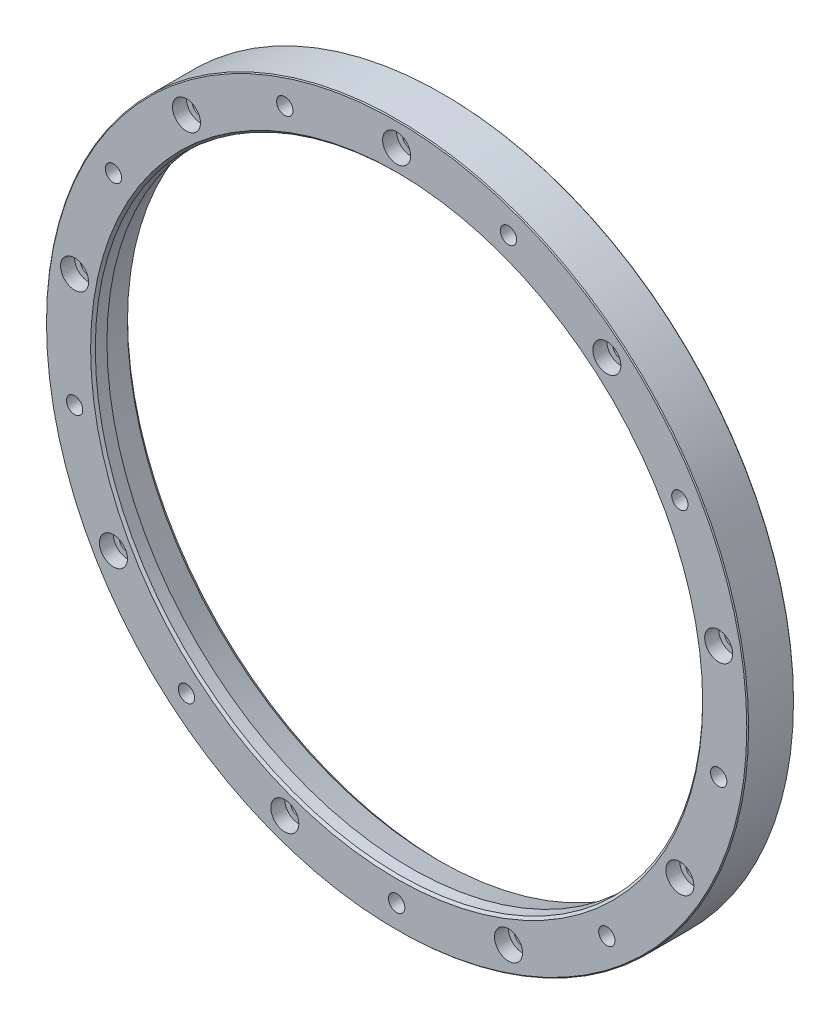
ISO-10303-21;
HEADER;
FILE_DESCRIPTION(('STEP AP214'),'2;1');
FILE_NAME('part.step','',(''),(''),'','','');
FILE_SCHEMA(('AUTOMOTIVE_DESIGN { 1 0 10303 214 1 1 1 1 }'));
ENDSEC;
DATA;
#1=APPLICATION_CONTEXT('core data for automotive mechanical design processes');
#2=APPLICATION_PROTOCOL_DEFINITION('international standard','automotive_design',2000,#1);
#3=PRODUCT_CONTEXT('',#1,'mechanical');
#4=PRODUCT('Part','Part','',(#3));
#5=PRODUCT_RELATED_PRODUCT_CATEGORY('part','',(#4));
#6=PRODUCT_DEFINITION_FORMATION('','',#4);
#7=PRODUCT_DEFINITION_CONTEXT('part definition',#1,'design');
#8=PRODUCT_DEFINITION('design','',#6,#7);
#9=PRODUCT_DEFINITION_SHAPE('','',#8);
#10=(LENGTH_UNIT() NAMED_UNIT(*) SI_UNIT(.MILLI.,.METRE.));
#11=(NAMED_UNIT(*) PLANE_ANGLE_UNIT() SI_UNIT($,.RADIAN.));
#12=(NAMED_UNIT(*) SI_UNIT($,.STERADIAN.) SOLID_ANGLE_UNIT());
#13=UNCERTAINTY_MEASURE_WITH_UNIT(LENGTH_MEASURE(1.E-05),#10,'distance_accuracy_value','');
#14=(GEOMETRIC_REPRESENTATION_CONTEXT(3) GLOBAL_UNCERTAINTY_ASSIGNED_CONTEXT((#13)) GLOBAL_UNIT_ASSIGNED_CONTEXT((#10,
#11,#12)) REPRESENTATION_CONTEXT('',''));
#15=CARTESIAN_POINT('',(0.,0.,0.));
#16=DIRECTION('',(0.,0.,1.));
#17=DIRECTION('',(1.,0.,0.));
#18=AXIS2_PLACEMENT_3D('',#15,#16,#17);
#19=CARTESIAN_POINT('',(0.,0.,0.999999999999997));
#20=DIRECTION('',(0.,0.,-1.));
#21=DIRECTION('',(-1.,0.,0.));
#22=AXIS2_PLACEMENT_3D('',#19,#20,#21);
#23=CONICAL_SURFACE('',#22,66.6176951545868,0.261799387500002);
#24=CARTESIAN_POINT('',(0.,0.,1.00000000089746));
#25=DIRECTION('',(0.,0.,-1.));
#26=DIRECTION('',(-1.,0.,0.));
#27=AXIS2_PLACEMENT_3D('',#24,#25,#26);
#28=CIRCLE('',#27,66.6176951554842);
#29=CARTESIAN_POINT('',(-66.6176951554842,0.,1.00000000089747));
#30=VERTEX_POINT('',#29);
#31=EDGE_CURVE('E40',#30,#30,#28,.T.);
#32=ORIENTED_EDGE('',*,*,#31,.T.);
#33=EDGE_LOOP('',(#32));
#34=FACE_BOUND('',#33,.T.);
#35=CARTESIAN_POINT('',(0.,0.,7.));
#36=DIRECTION('',(0.,0.,-1.));
#37=DIRECTION('',(-1.,0.,0.));
#38=AXIS2_PLACEMENT_3D('',#35,#36,#37);
#39=CIRCLE('',#38,65.01);
#40=CARTESIAN_POINT('',(-65.01,0.,7.));
#41=VERTEX_POINT('',#40);
#42=EDGE_CURVE('E47',#41,#41,#39,.F.);
#43=ORIENTED_EDGE('',*,*,#42,.T.);
#44=EDGE_LOOP('',(#43));
#45=FACE_BOUND('',#44,.T.);
#46=ADVANCED_FACE('F14',(#34,#45),#23,.F.);
#47=CARTESIAN_POINT('',(60.6217782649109,35.,6.));
#48=DIRECTION('',(0.,0.,-1.));
#49=DIRECTION('',(-1.,0.,0.));
#50=AXIS2_PLACEMENT_3D('',#47,#48,#49);
#51=PLANE('',#50);
#52=CARTESIAN_POINT('',(60.6217782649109,35.,6.));
#53=DIRECTION('',(0.,0.,-1.));
#54=DIRECTION('',(-1.,0.,0.));
#55=AXIS2_PLACEMENT_3D('',#52,#53,#54);
#56=CIRCLE('',#55,1.75);
#57=CARTESIAN_POINT('',(58.8717782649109,35.,6.));
#58=VERTEX_POINT('',#57);
#59=EDGE_CURVE('E220',#58,#58,#56,.F.);
#60=ORIENTED_EDGE('',*,*,#59,.T.);
#61=EDGE_LOOP('',(#60));
#62=FACE_BOUND('',#61,.T.);
#63=CARTESIAN_POINT('',(60.6217782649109,35.,6.00000000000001));
#64=DIRECTION('',(0.,0.,-1.));
#65=DIRECTION('',(-1.,0.,0.));
#66=AXIS2_PLACEMENT_3D('',#63,#64,#65);
#67=CIRCLE('',#66,1.3);
#68=CARTESIAN_POINT('',(59.3217782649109,35.,6.00000000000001));
#69=VERTEX_POINT('',#68);
#70=EDGE_CURVE('E17',#69,#69,#67,.T.);
#71=ORIENTED_EDGE('',*,*,#70,.T.);
#72=EDGE_LOOP('',(#71));
#73=FACE_BOUND('',#72,.T.);
#74=ADVANCED_FACE('F275',(#62,#73),#51,.F.);
#75=CARTESIAN_POINT('',(68.9365427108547,-12.1553724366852,6.));
#76=DIRECTION('',(0.,0.,-1.));
#77=DIRECTION('',(-1.,0.,0.));
#78=AXIS2_PLACEMENT_3D('',#75,#76,#77);
#79=PLANE('',#78);
#80=CARTESIAN_POINT('',(68.9365427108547,-12.1553724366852,6.));
#81=DIRECTION('',(0.,0.,-1.));
#82=DIRECTION('',(-1.,0.,0.));
#83=AXIS2_PLACEMENT_3D('',#80,#81,#82);
#84=CIRCLE('',#83,1.75);
#85=CARTESIAN_POINT('',(67.1865427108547,-12.1553724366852,6.));
#86=VERTEX_POINT('',#85);
#87=EDGE_CURVE('E217',#86,#86,#84,.F.);
#88=ORIENTED_EDGE('',*,*,#87,.T.);
#89=EDGE_LOOP('',(#88));
#90=FACE_BOUND('',#89,.T.);
#91=CARTESIAN_POINT('',(68.9365427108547,-12.1553724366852,6.00000000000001));
#92=DIRECTION('',(0.,0.,-1.));
#93=DIRECTION('',(-1.,0.,0.));
#94=AXIS2_PLACEMENT_3D('',#91,#92,#93);
#95=CIRCLE('',#94,1.3);
#96=CARTESIAN_POINT('',(67.6365427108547,-12.1553724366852,6.00000000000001));
#97=VERTEX_POINT('',#96);
#98=EDGE_CURVE('E268',#97,#97,#95,.T.);
#99=ORIENTED_EDGE('',*,*,#98,.T.);
#100=EDGE_LOOP('',(#99));
#101=FACE_BOUND('',#100,.T.);
#102=ADVANCED_FACE('F417',(#90,#101),#79,.F.);
#103=CARTESIAN_POINT('',(44.9951326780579,-53.6231110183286,6.));
#104=DIRECTION('',(0.,0.,-1.));
#105=DIRECTION('',(-1.,0.,0.));
#106=AXIS2_PLACEMENT_3D('',#103,#104,#105);
#107=PLANE('',#106);
#108=CARTESIAN_POINT('',(44.9951326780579,-53.6231110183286,6.));
#109=DIRECTION('',(0.,0.,-1.));
#110=DIRECTION('',(-1.,0.,0.));
#111=AXIS2_PLACEMENT_3D('',#108,#109,#110);
#112=CIRCLE('',#111,1.75);
#113=CARTESIAN_POINT('',(43.2451326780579,-53.6231110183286,6.));
#114=VERTEX_POINT('',#113);
#115=EDGE_CURVE('E214',#114,#114,#112,.F.);
#116=ORIENTED_EDGE('',*,*,#115,.T.);
#117=EDGE_LOOP('',(#116));
#118=FACE_BOUND('',#117,.T.);
#119=CARTESIAN_POINT('',(44.9951326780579,-53.6231110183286,6.00000000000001));
#120=DIRECTION('',(0.,0.,-1.));
#121=DIRECTION('',(-1.,0.,0.));
#122=AXIS2_PLACEMENT_3D('',#119,#120,#121);
#123=CIRCLE('',#122,1.3);
#124=CARTESIAN_POINT('',(43.6951326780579,-53.6231110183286,6.00000000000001));
#125=VERTEX_POINT('',#124);
#126=EDGE_CURVE('E266',#125,#125,#123,.T.);
#127=ORIENTED_EDGE('',*,*,#126,.T.);
#128=EDGE_LOOP('',(#127));
#129=FACE_BOUND('',#128,.T.);
#130=ADVANCED_FACE('F413',(#118,#129),#107,.F.);
#131=CARTESIAN_POINT('',(0.,-70.,6.));
#132=DIRECTION('',(0.,0.,-1.));
#133=DIRECTION('',(-1.,0.,0.));
#134=AXIS2_PLACEMENT_3D('',#131,#132,#133);
#135=PLANE('',#134);
#136=CARTESIAN_POINT('',(0.,-70.,6.));
#137=DIRECTION('',(0.,0.,-1.));
#138=DIRECTION('',(-1.,0.,0.));
#139=AXIS2_PLACEMENT_3D('',#136,#137,#138);
#140=CIRCLE('',#139,1.75);
#141=CARTESIAN_POINT('',(-1.75000000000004,-70.,6.));
#142=VERTEX_POINT('',#141);
#143=EDGE_CURVE('E211',#142,#142,#140,.F.);
#144=ORIENTED_EDGE('',*,*,#143,.T.);
#145=EDGE_LOOP('',(#144));
#146=FACE_BOUND('',#145,.T.);
#147=CARTESIAN_POINT('',(0.,-70.,6.00000000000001));
#148=DIRECTION('',(0.,0.,-1.));
#149=DIRECTION('',(-1.,0.,0.));
#150=AXIS2_PLACEMENT_3D('',#147,#148,#149);
#151=CIRCLE('',#150,1.3);
#152=CARTESIAN_POINT('',(-1.30000000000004,-70.,6.00000000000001));
#153=VERTEX_POINT('',#152);
#154=EDGE_CURVE('E263',#153,#153,#151,.T.);
#155=ORIENTED_EDGE('',*,*,#154,.T.);
#156=EDGE_LOOP('',(#155));
#157=FACE_BOUND('',#156,.T.);
#158=ADVANCED_FACE('F409',(#146,#157),#135,.F.);
#159=CARTESIAN_POINT('',(-44.9951326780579,-53.6231110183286,6.));
#160=DIRECTION('',(0.,0.,-1.));
#161=DIRECTION('',(-1.,0.,0.));
#162=AXIS2_PLACEMENT_3D('',#159,#160,#161);
#163=PLANE('',#162);
#164=CARTESIAN_POINT('',(-44.9951326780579,-53.6231110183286,6.));
#165=DIRECTION('',(0.,0.,-1.));
#166=DIRECTION('',(-1.,0.,0.));
#167=AXIS2_PLACEMENT_3D('',#164,#165,#166);
#168=CIRCLE('',#167,1.75);
#169=CARTESIAN_POINT('',(-46.7451326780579,-53.6231110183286,6.));
#170=VERTEX_POINT('',#169);
#171=EDGE_CURVE('E208',#170,#170,#168,.F.);
#172=ORIENTED_EDGE('',*,*,#171,.T.);
#173=EDGE_LOOP('',(#172));
#174=FACE_BOUND('',#173,.T.);
#175=CARTESIAN_POINT('',(-44.9951326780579,-53.6231110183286,6.00000000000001));
#176=DIRECTION('',(0.,0.,-1.));
#177=DIRECTION('',(-1.,0.,0.));
#178=AXIS2_PLACEMENT_3D('',#175,#176,#177);
#179=CIRCLE('',#178,1.3);
#180=CARTESIAN_POINT('',(-46.2951326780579,-53.6231110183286,6.00000000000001));
#181=VERTEX_POINT('',#180);
#182=EDGE_CURVE('E260',#181,#181,#179,.T.);
#183=ORIENTED_EDGE('',*,*,#182,.T.);
#184=EDGE_LOOP('',(#183));
#185=FACE_BOUND('',#184,.T.);
#186=ADVANCED_FACE('F405',(#174,#185),#163,.F.);
#187=CARTESIAN_POINT('',(-68.9365427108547,-12.1553724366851,6.));
#188=DIRECTION('',(0.,0.,-1.));
#189=DIRECTION('',(-1.,0.,0.));
#190=AXIS2_PLACEMENT_3D('',#187,#188,#189);
#191=PLANE('',#190);
#192=CARTESIAN_POINT('',(-68.9365427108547,-12.1553724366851,6.));
#193=DIRECTION('',(0.,0.,-1.));
#194=DIRECTION('',(-1.,0.,0.));
#195=AXIS2_PLACEMENT_3D('',#192,#193,#194);
#196=CIRCLE('',#195,1.75);
#197=CARTESIAN_POINT('',(-70.6865427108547,-12.1553724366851,6.));
#198=VERTEX_POINT('',#197);
#199=EDGE_CURVE('E205',#198,#198,#196,.F.);
#200=ORIENTED_EDGE('',*,*,#199,.T.);
#201=EDGE_LOOP('',(#200));
#202=FACE_BOUND('',#201,.T.);
#203=CARTESIAN_POINT('',(-68.9365427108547,-12.1553724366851,6.00000000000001));
#204=DIRECTION('',(0.,0.,-1.));
#205=DIRECTION('',(-1.,0.,0.));
#206=AXIS2_PLACEMENT_3D('',#203,#204,#205);
#207=CIRCLE('',#206,1.3);
#208=CARTESIAN_POINT('',(-70.2365427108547,-12.1553724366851,6.00000000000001));
#209=VERTEX_POINT('',#208);
#210=EDGE_CURVE('E257',#209,#209,#207,.T.);
#211=ORIENTED_EDGE('',*,*,#210,.T.);
#212=EDGE_LOOP('',(#211));
#213=FACE_BOUND('',#212,.T.);
#214=ADVANCED_FACE('F401',(#202,#213),#191,.F.);
#215=CARTESIAN_POINT('',(-60.6217782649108,35.,6.));
#216=DIRECTION('',(0.,0.,-1.));
#217=DIRECTION('',(-1.,0.,0.));
#218=AXIS2_PLACEMENT_3D('',#215,#216,#217);
#219=PLANE('',#218);
#220=CARTESIAN_POINT('',(-60.6217782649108,35.,6.));
#221=DIRECTION('',(0.,0.,-1.));
#222=DIRECTION('',(-1.,0.,0.));
#223=AXIS2_PLACEMENT_3D('',#220,#221,#222);
#224=CIRCLE('',#223,1.75);
#225=CARTESIAN_POINT('',(-62.3717782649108,35.,6.));
#226=VERTEX_POINT('',#225);
#227=EDGE_CURVE('E202',#226,#226,#224,.F.);
#228=ORIENTED_EDGE('',*,*,#227,.T.);
#229=EDGE_LOOP('',(#228));
#230=FACE_BOUND('',#229,.T.);
#231=CARTESIAN_POINT('',(-60.6217782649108,35.,6.00000000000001));
#232=DIRECTION('',(0.,0.,-1.));
#233=DIRECTION('',(-1.,0.,0.));
#234=AXIS2_PLACEMENT_3D('',#231,#232,#233);
#235=CIRCLE('',#234,1.3);
#236=CARTESIAN_POINT('',(-61.9217782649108,35.,6.00000000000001));
#237=VERTEX_POINT('',#236);
#238=EDGE_CURVE('E254',#237,#237,#235,.T.);
#239=ORIENTED_EDGE('',*,*,#238,.T.);
#240=EDGE_LOOP('',(#239));
#241=FACE_BOUND('',#240,.T.);
#242=ADVANCED_FACE('F397',(#230,#241),#219,.F.);
#243=CARTESIAN_POINT('',(-23.9414100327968,65.7784834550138,6.));
#244=DIRECTION('',(0.,0.,-1.));
#245=DIRECTION('',(-1.,0.,0.));
#246=AXIS2_PLACEMENT_3D('',#243,#244,#245);
#247=PLANE('',#246);
#248=CARTESIAN_POINT('',(-23.9414100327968,65.7784834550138,6.));
#249=DIRECTION('',(0.,0.,-1.));
#250=DIRECTION('',(-1.,0.,0.));
#251=AXIS2_PLACEMENT_3D('',#248,#249,#250);
#252=CIRCLE('',#251,1.75);
#253=CARTESIAN_POINT('',(-25.6914100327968,65.7784834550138,6.));
#254=VERTEX_POINT('',#253);
#255=EDGE_CURVE('E199',#254,#254,#252,.F.);
#256=ORIENTED_EDGE('',*,*,#255,.T.);
#257=EDGE_LOOP('',(#256));
#258=FACE_BOUND('',#257,.T.);
#259=CARTESIAN_POINT('',(-23.9414100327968,65.7784834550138,6.00000000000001));
#260=DIRECTION('',(0.,0.,-1.));
#261=DIRECTION('',(-1.,0.,0.));
#262=AXIS2_PLACEMENT_3D('',#259,#260,#261);
#263=CIRCLE('',#262,1.3);
#264=CARTESIAN_POINT('',(-25.2414100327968,65.7784834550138,6.00000000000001));
#265=VERTEX_POINT('',#264);
#266=EDGE_CURVE('E251',#265,#265,#263,.T.);
#267=ORIENTED_EDGE('',*,*,#266,.T.);
#268=EDGE_LOOP('',(#267));
#269=FACE_BOUND('',#268,.T.);
#270=ADVANCED_FACE('F393',(#258,#269),#247,.F.);
#271=CARTESIAN_POINT('',(23.9414100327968,65.7784834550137,6.));
#272=DIRECTION('',(0.,0.,-1.));
#273=DIRECTION('',(-1.,0.,0.));
#274=AXIS2_PLACEMENT_3D('',#271,#272,#273);
#275=PLANE('',#274);
#276=CARTESIAN_POINT('',(23.9414100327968,65.7784834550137,6.));
#277=DIRECTION('',(0.,0.,-1.));
#278=DIRECTION('',(-1.,0.,0.));
#279=AXIS2_PLACEMENT_3D('',#276,#277,#278);
#280=CIRCLE('',#279,1.75);
#281=CARTESIAN_POINT('',(22.1914100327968,65.7784834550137,6.));
#282=VERTEX_POINT('',#281);
#283=EDGE_CURVE('E37',#282,#282,#280,.F.);
#284=ORIENTED_EDGE('',*,*,#283,.T.);
#285=EDGE_LOOP('',(#284));
#286=FACE_BOUND('',#285,.T.);
#287=CARTESIAN_POINT('',(23.9414100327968,65.7784834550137,6.00000000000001));
#288=DIRECTION('',(0.,0.,-1.));
#289=DIRECTION('',(-1.,0.,0.));
#290=AXIS2_PLACEMENT_3D('',#287,#288,#289);
#291=CIRCLE('',#290,1.3);
#292=CARTESIAN_POINT('',(22.6414100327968,65.7784834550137,6.00000000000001));
#293=VERTEX_POINT('',#292);
#294=EDGE_CURVE('E44',#293,#293,#291,.T.);
#295=ORIENTED_EDGE('',*,*,#294,.T.);
#296=EDGE_LOOP('',(#295));
#297=FACE_BOUND('',#296,.T.);
#298=ADVANCED_FACE('F389',(#286,#297),#275,.F.);
#299=CARTESIAN_POINT('',(0.,0.,10.));
#300=DIRECTION('',(0.,0.,-1.));
#301=DIRECTION('',(-1.,0.,0.));
#302=AXIS2_PLACEMENT_3D('',#299,#300,#301);
#303=CYLINDRICAL_SURFACE('',#302,65.01);
#304=ORIENTED_EDGE('',*,*,#42,.F.);
#305=EDGE_LOOP('',(#304));
#306=FACE_BOUND('',#305,.T.);
#307=CARTESIAN_POINT('',(0.,0.,9.49999999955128));
#308=DIRECTION('',(0.,0.,1.));
#309=DIRECTION('',(1.,0.,0.));
#310=AXIS2_PLACEMENT_3D('',#307,#308,#309);
#311=CIRCLE('',#310,65.0100000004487);
#312=CARTESIAN_POINT('',(65.0100000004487,0.,9.49999999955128));
#313=VERTEX_POINT('',#312);
#314=EDGE_CURVE('E33',#313,#313,#311,.T.);
#315=ORIENTED_EDGE('',*,*,#314,.T.);
#316=EDGE_LOOP('',(#315));
#317=FACE_BOUND('',#316,.T.);
#318=ADVANCED_FACE('F385',(#306,#317),#303,.F.);
#319=CARTESIAN_POINT('',(44.9951326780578,53.6231110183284,7.));
#320=DIRECTION('',(0.,0.,-1.));
#321=DIRECTION('',(-1.,0.,0.));
#322=AXIS2_PLACEMENT_3D('',#319,#320,#321);
#323=PLANE('',#322);
#324=CARTESIAN_POINT('',(44.9951326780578,53.6231110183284,7.));
#325=DIRECTION('',(0.,0.,-1.));
#326=DIRECTION('',(-1.,0.,0.));
#327=AXIS2_PLACEMENT_3D('',#324,#325,#326);
#328=CIRCLE('',#327,3.);
#329=CARTESIAN_POINT('',(41.9951326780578,53.6231110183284,7.));
#330=VERTEX_POINT('',#329);
#331=EDGE_CURVE('E36',#330,#330,#328,.F.);
#332=ORIENTED_EDGE('',*,*,#331,.T.);
#333=EDGE_LOOP('',(#332));
#334=FACE_BOUND('',#333,.T.);
#335=CARTESIAN_POINT('',(44.9951326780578,53.6231110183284,7.00000000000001));
#336=DIRECTION('',(0.,0.,-1.));
#337=DIRECTION('',(-1.,0.,0.));
#338=AXIS2_PLACEMENT_3D('',#335,#336,#337);
#339=CIRCLE('',#338,1.75);
#340=CARTESIAN_POINT('',(43.2451326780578,53.6231110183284,7.00000000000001));
#341=VERTEX_POINT('',#340);
#342=EDGE_CURVE('E43',#341,#341,#339,.T.);
#343=ORIENTED_EDGE('',*,*,#342,.T.);
#344=EDGE_LOOP('',(#343));
#345=FACE_BOUND('',#344,.T.);
#346=ADVANCED_FACE('F381',(#334,#345),#323,.F.);
#347=CARTESIAN_POINT('',(68.9365427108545,12.1553724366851,7.));
#348=DIRECTION('',(0.,0.,-1.));
#349=DIRECTION('',(-1.,0.,0.));
#350=AXIS2_PLACEMENT_3D('',#347,#348,#349);
#351=PLANE('',#350);
#352=CARTESIAN_POINT('',(68.9365427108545,12.1553724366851,7.));
#353=DIRECTION('',(0.,0.,-1.));
#354=DIRECTION('',(-1.,0.,0.));
#355=AXIS2_PLACEMENT_3D('',#352,#353,#354);
#356=CIRCLE('',#355,3.);
#357=CARTESIAN_POINT('',(65.9365427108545,12.1553724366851,7.));
#358=VERTEX_POINT('',#357);
#359=EDGE_CURVE('E192',#358,#358,#356,.F.);
#360=ORIENTED_EDGE('',*,*,#359,.T.);
#361=EDGE_LOOP('',(#360));
#362=FACE_BOUND('',#361,.T.);
#363=CARTESIAN_POINT('',(68.9365427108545,12.1553724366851,7.00000000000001));
#364=DIRECTION('',(0.,0.,-1.));
#365=DIRECTION('',(-1.,0.,0.));
#366=AXIS2_PLACEMENT_3D('',#363,#364,#365);
#367=CIRCLE('',#366,1.75);
#368=CARTESIAN_POINT('',(67.1865427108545,12.1553724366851,7.00000000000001));
#369=VERTEX_POINT('',#368);
#370=EDGE_CURVE('E244',#369,#369,#367,.T.);
#371=ORIENTED_EDGE('',*,*,#370,.T.);
#372=EDGE_LOOP('',(#371));
#373=FACE_BOUND('',#372,.T.);
#374=ADVANCED_FACE('F377',(#362,#373),#351,.F.);
#375=CARTESIAN_POINT('',(60.6217782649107,-35.,7.));
#376=DIRECTION('',(0.,0.,-1.));
#377=DIRECTION('',(-1.,0.,0.));
#378=AXIS2_PLACEMENT_3D('',#375,#376,#377);
#379=PLANE('',#378);
#380=CARTESIAN_POINT('',(60.6217782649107,-35.,7.));
#381=DIRECTION('',(0.,0.,-1.));
#382=DIRECTION('',(-1.,0.,0.));
#383=AXIS2_PLACEMENT_3D('',#380,#381,#382);
#384=CIRCLE('',#383,3.);
#385=CARTESIAN_POINT('',(57.6217782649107,-35.,7.));
#386=VERTEX_POINT('',#385);
#387=EDGE_CURVE('E189',#386,#386,#384,.F.);
#388=ORIENTED_EDGE('',*,*,#387,.T.);
#389=EDGE_LOOP('',(#388));
#390=FACE_BOUND('',#389,.T.);
#391=CARTESIAN_POINT('',(60.6217782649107,-35.,7.00000000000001));
#392=DIRECTION('',(0.,0.,-1.));
#393=DIRECTION('',(-1.,0.,0.));
#394=AXIS2_PLACEMENT_3D('',#391,#392,#393);
#395=CIRCLE('',#394,1.75);
#396=CARTESIAN_POINT('',(58.8717782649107,-35.,7.00000000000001));
#397=VERTEX_POINT('',#396);
#398=EDGE_CURVE('E241',#397,#397,#395,.T.);
#399=ORIENTED_EDGE('',*,*,#398,.T.);
#400=EDGE_LOOP('',(#399));
#401=FACE_BOUND('',#400,.T.);
#402=ADVANCED_FACE('F373',(#390,#401),#379,.F.);
#403=CARTESIAN_POINT('',(23.9414100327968,-65.7784834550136,7.));
#404=DIRECTION('',(0.,0.,-1.));
#405=DIRECTION('',(-1.,0.,0.));
#406=AXIS2_PLACEMENT_3D('',#403,#404,#405);
#407=PLANE('',#406);
#408=CARTESIAN_POINT('',(23.9414100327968,-65.7784834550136,7.));
#409=DIRECTION('',(0.,0.,-1.));
#410=DIRECTION('',(-1.,0.,0.));
#411=AXIS2_PLACEMENT_3D('',#408,#409,#410);
#412=CIRCLE('',#411,3.);
#413=CARTESIAN_POINT('',(20.9414100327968,-65.7784834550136,7.));
#414=VERTEX_POINT('',#413);
#415=EDGE_CURVE('E186',#414,#414,#412,.F.);
#416=ORIENTED_EDGE('',*,*,#415,.T.);
#417=EDGE_LOOP('',(#416));
#418=FACE_BOUND('',#417,.T.);
#419=CARTESIAN_POINT('',(23.9414100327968,-65.7784834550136,7.00000000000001));
#420=DIRECTION('',(0.,0.,-1.));
#421=DIRECTION('',(-1.,0.,0.));
#422=AXIS2_PLACEMENT_3D('',#419,#420,#421);
#423=CIRCLE('',#422,1.75);
#424=CARTESIAN_POINT('',(22.1914100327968,-65.7784834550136,7.00000000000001));
#425=VERTEX_POINT('',#424);
#426=EDGE_CURVE('E238',#425,#425,#423,.T.);
#427=ORIENTED_EDGE('',*,*,#426,.T.);
#428=EDGE_LOOP('',(#427));
#429=FACE_BOUND('',#428,.T.);
#430=ADVANCED_FACE('F369',(#418,#429),#407,.F.);
#431=CARTESIAN_POINT('',(-23.9414100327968,-65.7784834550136,7.));
#432=DIRECTION('',(0.,0.,-1.));
#433=DIRECTION('',(-1.,0.,0.));
#434=AXIS2_PLACEMENT_3D('',#431,#432,#433);
#435=PLANE('',#434);
#436=CARTESIAN_POINT('',(-23.9414100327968,-65.7784834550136,7.));
#437=DIRECTION('',(0.,0.,-1.));
#438=DIRECTION('',(-1.,0.,0.));
#439=AXIS2_PLACEMENT_3D('',#436,#437,#438);
#440=CIRCLE('',#439,3.);
#441=CARTESIAN_POINT('',(-26.9414100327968,-65.7784834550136,7.));
#442=VERTEX_POINT('',#441);
#443=EDGE_CURVE('E183',#442,#442,#440,.F.);
#444=ORIENTED_EDGE('',*,*,#443,.T.);
#445=EDGE_LOOP('',(#444));
#446=FACE_BOUND('',#445,.T.);
#447=CARTESIAN_POINT('',(-23.9414100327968,-65.7784834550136,7.00000000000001));
#448=DIRECTION('',(0.,0.,-1.));
#449=DIRECTION('',(-1.,0.,0.));
#450=AXIS2_PLACEMENT_3D('',#447,#448,#449);
#451=CIRCLE('',#450,1.75);
#452=CARTESIAN_POINT('',(-25.6914100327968,-65.7784834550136,7.00000000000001));
#453=VERTEX_POINT('',#452);
#454=EDGE_CURVE('E235',#453,#453,#451,.T.);
#455=ORIENTED_EDGE('',*,*,#454,.T.);
#456=EDGE_LOOP('',(#455));
#457=FACE_BOUND('',#456,.T.);
#458=ADVANCED_FACE('F365',(#446,#457),#435,.F.);
#459=CARTESIAN_POINT('',(-60.6217782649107,-35.,7.));
#460=DIRECTION('',(0.,0.,-1.));
#461=DIRECTION('',(-1.,0.,0.));
#462=AXIS2_PLACEMENT_3D('',#459,#460,#461);
#463=PLANE('',#462);
#464=CARTESIAN_POINT('',(-60.6217782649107,-35.,7.));
#465=DIRECTION('',(0.,0.,-1.));
#466=DIRECTION('',(-1.,0.,0.));
#467=AXIS2_PLACEMENT_3D('',#464,#465,#466);
#468=CIRCLE('',#467,3.);
#469=CARTESIAN_POINT('',(-63.6217782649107,-35.,7.));
#470=VERTEX_POINT('',#469);
#471=EDGE_CURVE('E180',#470,#470,#468,.F.);
#472=ORIENTED_EDGE('',*,*,#471,.T.);
#473=EDGE_LOOP('',(#472));
#474=FACE_BOUND('',#473,.T.);
#475=CARTESIAN_POINT('',(-60.6217782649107,-35.,7.00000000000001));
#476=DIRECTION('',(0.,0.,-1.));
#477=DIRECTION('',(-1.,0.,0.));
#478=AXIS2_PLACEMENT_3D('',#475,#476,#477);
#479=CIRCLE('',#478,1.75);
#480=CARTESIAN_POINT('',(-62.3717782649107,-35.,7.00000000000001));
#481=VERTEX_POINT('',#480);
#482=EDGE_CURVE('E232',#481,#481,#479,.T.);
#483=ORIENTED_EDGE('',*,*,#482,.T.);
#484=EDGE_LOOP('',(#483));
#485=FACE_BOUND('',#484,.T.);
#486=ADVANCED_FACE('F361',(#474,#485),#463,.F.);
#487=CARTESIAN_POINT('',(-68.9365427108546,12.1553724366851,7.));
#488=DIRECTION('',(0.,0.,-1.));
#489=DIRECTION('',(-1.,0.,0.));
#490=AXIS2_PLACEMENT_3D('',#487,#488,#489);
#491=PLANE('',#490);
#492=CARTESIAN_POINT('',(-68.9365427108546,12.1553724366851,7.));
#493=DIRECTION('',(0.,0.,-1.));
#494=DIRECTION('',(-1.,0.,0.));
#495=AXIS2_PLACEMENT_3D('',#492,#493,#494);
#496=CIRCLE('',#495,3.);
#497=CARTESIAN_POINT('',(-71.9365427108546,12.1553724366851,7.));
#498=VERTEX_POINT('',#497);
#499=EDGE_CURVE('E177',#498,#498,#496,.F.);
#500=ORIENTED_EDGE('',*,*,#499,.T.);
#501=EDGE_LOOP('',(#500));
#502=FACE_BOUND('',#501,.T.);
#503=CARTESIAN_POINT('',(-68.9365427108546,12.1553724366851,7.00000000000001));
#504=DIRECTION('',(0.,0.,-1.));
#505=DIRECTION('',(-1.,0.,0.));
#506=AXIS2_PLACEMENT_3D('',#503,#504,#505);
#507=CIRCLE('',#506,1.75);
#508=CARTESIAN_POINT('',(-70.6865427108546,12.1553724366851,7.00000000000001));
#509=VERTEX_POINT('',#508);
#510=EDGE_CURVE('E229',#509,#509,#507,.T.);
#511=ORIENTED_EDGE('',*,*,#510,.T.);
#512=EDGE_LOOP('',(#511));
#513=FACE_BOUND('',#512,.T.);
#514=ADVANCED_FACE('F357',(#502,#513),#491,.F.);
#515=CARTESIAN_POINT('',(-44.9951326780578,53.6231110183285,7.));
#516=DIRECTION('',(0.,0.,-1.));
#517=DIRECTION('',(-1.,0.,0.));
#518=AXIS2_PLACEMENT_3D('',#515,#516,#517);
#519=PLANE('',#518);
#520=CARTESIAN_POINT('',(-44.9951326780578,53.6231110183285,7.));
#521=DIRECTION('',(0.,0.,-1.));
#522=DIRECTION('',(-1.,0.,0.));
#523=AXIS2_PLACEMENT_3D('',#520,#521,#522);
#524=CIRCLE('',#523,3.);
#525=CARTESIAN_POINT('',(-47.9951326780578,53.6231110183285,7.));
#526=VERTEX_POINT('',#525);
#527=EDGE_CURVE('E174',#526,#526,#524,.F.);
#528=ORIENTED_EDGE('',*,*,#527,.T.);
#529=EDGE_LOOP('',(#528));
#530=FACE_BOUND('',#529,.T.);
#531=CARTESIAN_POINT('',(-44.9951326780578,53.6231110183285,7.00000000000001));
#532=DIRECTION('',(0.,0.,-1.));
#533=DIRECTION('',(-1.,0.,0.));
#534=AXIS2_PLACEMENT_3D('',#531,#532,#533);
#535=CIRCLE('',#534,1.75);
#536=CARTESIAN_POINT('',(-46.7451326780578,53.6231110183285,7.00000000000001));
#537=VERTEX_POINT('',#536);
#538=EDGE_CURVE('E226',#537,#537,#535,.T.);
#539=ORIENTED_EDGE('',*,*,#538,.T.);
#540=EDGE_LOOP('',(#539));
#541=FACE_BOUND('',#540,.T.);
#542=ADVANCED_FACE('F353',(#530,#541),#519,.F.);
#543=CARTESIAN_POINT('',(0.,70.,7.));
#544=DIRECTION('',(0.,0.,-1.));
#545=DIRECTION('',(-1.,0.,0.));
#546=AXIS2_PLACEMENT_3D('',#543,#544,#545);
#547=PLANE('',#546);
#548=CARTESIAN_POINT('',(0.,70.,7.));
#549=DIRECTION('',(0.,0.,-1.));
#550=DIRECTION('',(-1.,0.,0.));
#551=AXIS2_PLACEMENT_3D('',#548,#549,#550);
#552=CIRCLE('',#551,3.);
#553=CARTESIAN_POINT('',(-3.,70.,7.));
#554=VERTEX_POINT('',#553);
#555=EDGE_CURVE('E171',#554,#554,#552,.F.);
#556=ORIENTED_EDGE('',*,*,#555,.T.);
#557=EDGE_LOOP('',(#556));
#558=FACE_BOUND('',#557,.T.);
#559=CARTESIAN_POINT('',(0.,70.,7.00000000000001));
#560=DIRECTION('',(0.,0.,-1.));
#561=DIRECTION('',(-1.,0.,0.));
#562=AXIS2_PLACEMENT_3D('',#559,#560,#561);
#563=CIRCLE('',#562,1.75);
#564=CARTESIAN_POINT('',(-1.75,70.,7.00000000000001));
#565=VERTEX_POINT('',#564);
#566=EDGE_CURVE('E223',#565,#565,#563,.T.);
#567=ORIENTED_EDGE('',*,*,#566,.T.);
#568=EDGE_LOOP('',(#567));
#569=FACE_BOUND('',#568,.T.);
#570=ADVANCED_FACE('F281',(#558,#569),#547,.F.);
#571=CARTESIAN_POINT('',(60.6217782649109,35.,-89.4198099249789));
#572=DIRECTION('',(0.,0.,-1.));
#573=DIRECTION('',(-1.,0.,0.));
#574=AXIS2_PLACEMENT_3D('',#571,#572,#573);
#575=CYLINDRICAL_SURFACE('',#574,1.3);
#576=ORIENTED_EDGE('',*,*,#70,.F.);
#577=EDGE_LOOP('',(#576));
#578=FACE_BOUND('',#577,.T.);
#579=CARTESIAN_POINT('',(60.6217782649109,35.,0.));
#580=DIRECTION('',(0.,0.,-1.));
#581=DIRECTION('',(-1.,0.,0.));
#582=AXIS2_PLACEMENT_3D('',#579,#580,#581);
#583=CIRCLE('',#582,1.3);
#584=CARTESIAN_POINT('',(59.3217782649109,35.,0.));
#585=VERTEX_POINT('',#584);
#586=EDGE_CURVE('E168',#585,#585,#583,.F.);
#587=ORIENTED_EDGE('',*,*,#586,.F.);
#588=EDGE_LOOP('',(#587));
#589=FACE_BOUND('',#588,.T.);
#590=ADVANCED_FACE('F277',(#578,#589),#575,.F.);
#591=CARTESIAN_POINT('',(68.9365427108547,-12.1553724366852,-89.4198099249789));
#592=DIRECTION('',(0.,0.,-1.));
#593=DIRECTION('',(-1.,0.,0.));
#594=AXIS2_PLACEMENT_3D('',#591,#592,#593);
#595=CYLINDRICAL_SURFACE('',#594,1.3);
#596=ORIENTED_EDGE('',*,*,#98,.F.);
#597=EDGE_LOOP('',(#596));
#598=FACE_BOUND('',#597,.T.);
#599=CARTESIAN_POINT('',(68.9365427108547,-12.1553724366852,0.));
#600=DIRECTION('',(0.,0.,-1.));
#601=DIRECTION('',(-1.,0.,0.));
#602=AXIS2_PLACEMENT_3D('',#599,#600,#601);
#603=CIRCLE('',#602,1.3);
#604=CARTESIAN_POINT('',(67.6365427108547,-12.1553724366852,0.));
#605=VERTEX_POINT('',#604);
#606=EDGE_CURVE('E165',#605,#605,#603,.F.);
#607=ORIENTED_EDGE('',*,*,#606,.F.);
#608=EDGE_LOOP('',(#607));
#609=FACE_BOUND('',#608,.T.);
#610=ADVANCED_FACE('F280',(#598,#609),#595,.F.);
#611=CARTESIAN_POINT('',(44.9951326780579,-53.6231110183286,-89.4198099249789));
#612=DIRECTION('',(0.,0.,-1.));
#613=DIRECTION('',(-1.,0.,0.));
#614=AXIS2_PLACEMENT_3D('',#611,#612,#613);
#615=CYLINDRICAL_SURFACE('',#614,1.3);
#616=ORIENTED_EDGE('',*,*,#126,.F.);
#617=EDGE_LOOP('',(#616));
#618=FACE_BOUND('',#617,.T.);
#619=CARTESIAN_POINT('',(44.9951326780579,-53.6231110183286,0.));
#620=DIRECTION('',(0.,0.,-1.));
#621=DIRECTION('',(-1.,0.,0.));
#622=AXIS2_PLACEMENT_3D('',#619,#620,#621);
#623=CIRCLE('',#622,1.3);
#624=CARTESIAN_POINT('',(43.6951326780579,-53.6231110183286,0.));
#625=VERTEX_POINT('',#624);
#626=EDGE_CURVE('E162',#625,#625,#623,.F.);
#627=ORIENTED_EDGE('',*,*,#626,.F.);
#628=EDGE_LOOP('',(#627));
#629=FACE_BOUND('',#628,.T.);
#630=ADVANCED_FACE('F340',(#618,#629),#615,.F.);
#631=CARTESIAN_POINT('',(0.,-70.,-89.4198099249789));
#632=DIRECTION('',(0.,0.,-1.));
#633=DIRECTION('',(-1.,0.,0.));
#634=AXIS2_PLACEMENT_3D('',#631,#632,#633);
#635=CYLINDRICAL_SURFACE('',#634,1.3);
#636=ORIENTED_EDGE('',*,*,#154,.F.);
#637=EDGE_LOOP('',(#636));
#638=FACE_BOUND('',#637,.T.);
#639=CARTESIAN_POINT('',(0.,-70.,0.));
#640=DIRECTION('',(0.,0.,-1.));
#641=DIRECTION('',(-1.,0.,0.));
#642=AXIS2_PLACEMENT_3D('',#639,#640,#641);
#643=CIRCLE('',#642,1.3);
#644=CARTESIAN_POINT('',(-1.30000000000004,-70.,0.));
#645=VERTEX_POINT('',#644);
#646=EDGE_CURVE('E159',#645,#645,#643,.F.);
#647=ORIENTED_EDGE('',*,*,#646,.F.);
#648=EDGE_LOOP('',(#647));
#649=FACE_BOUND('',#648,.T.);
#650=ADVANCED_FACE('F346',(#638,#649),#635,.F.);
#651=CARTESIAN_POINT('',(-44.9951326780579,-53.6231110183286,-89.4198099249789));
#652=DIRECTION('',(0.,0.,-1.));
#653=DIRECTION('',(-1.,0.,0.));
#654=AXIS2_PLACEMENT_3D('',#651,#652,#653);
#655=CYLINDRICAL_SURFACE('',#654,1.3);
#656=ORIENTED_EDGE('',*,*,#182,.F.);
#657=EDGE_LOOP('',(#656));
#658=FACE_BOUND('',#657,.T.);
#659=CARTESIAN_POINT('',(-44.9951326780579,-53.6231110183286,0.));
#660=DIRECTION('',(0.,0.,-1.));
#661=DIRECTION('',(-1.,0.,0.));
#662=AXIS2_PLACEMENT_3D('',#659,#660,#661);
#663=CIRCLE('',#662,1.3);
#664=CARTESIAN_POINT('',(-46.2951326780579,-53.6231110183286,0.));
#665=VERTEX_POINT('',#664);
#666=EDGE_CURVE('E156',#665,#665,#663,.F.);
#667=ORIENTED_EDGE('',*,*,#666,.F.);
#668=EDGE_LOOP('',(#667));
#669=FACE_BOUND('',#668,.T.);
#670=ADVANCED_FACE('F498',(#658,#669),#655,.F.);
#671=CARTESIAN_POINT('',(-68.9365427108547,-12.1553724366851,-89.4198099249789));
#672=DIRECTION('',(0.,0.,-1.));
#673=DIRECTION('',(-1.,0.,0.));
#674=AXIS2_PLACEMENT_3D('',#671,#672,#673);
#675=CYLINDRICAL_SURFACE('',#674,1.3);
#676=ORIENTED_EDGE('',*,*,#210,.F.);
#677=EDGE_LOOP('',(#676));
#678=FACE_BOUND('',#677,.T.);
#679=CARTESIAN_POINT('',(-68.9365427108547,-12.1553724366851,0.));
#680=DIRECTION('',(0.,0.,-1.));
#681=DIRECTION('',(-1.,0.,0.));
#682=AXIS2_PLACEMENT_3D('',#679,#680,#681);
#683=CIRCLE('',#682,1.3);
#684=CARTESIAN_POINT('',(-70.2365427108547,-12.1553724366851,0.));
#685=VERTEX_POINT('',#684);
#686=EDGE_CURVE('E153',#685,#685,#683,.F.);
#687=ORIENTED_EDGE('',*,*,#686,.F.);
#688=EDGE_LOOP('',(#687));
#689=FACE_BOUND('',#688,.T.);
#690=ADVANCED_FACE('F494',(#678,#689),#675,.F.);
#691=CARTESIAN_POINT('',(-60.6217782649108,35.,-89.4198099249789));
#692=DIRECTION('',(0.,0.,-1.));
#693=DIRECTION('',(-1.,0.,0.));
#694=AXIS2_PLACEMENT_3D('',#691,#692,#693);
#695=CYLINDRICAL_SURFACE('',#694,1.3);
#696=ORIENTED_EDGE('',*,*,#238,.F.);
#697=EDGE_LOOP('',(#696));
#698=FACE_BOUND('',#697,.T.);
#699=CARTESIAN_POINT('',(-60.6217782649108,35.,0.));
#700=DIRECTION('',(0.,0.,-1.));
#701=DIRECTION('',(-1.,0.,0.));
#702=AXIS2_PLACEMENT_3D('',#699,#700,#701);
#703=CIRCLE('',#702,1.3);
#704=CARTESIAN_POINT('',(-61.9217782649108,35.,0.));
#705=VERTEX_POINT('',#704);
#706=EDGE_CURVE('E150',#705,#705,#703,.F.);
#707=ORIENTED_EDGE('',*,*,#706,.F.);
#708=EDGE_LOOP('',(#707));
#709=FACE_BOUND('',#708,.T.);
#710=ADVANCED_FACE('F490',(#698,#709),#695,.F.);
#711=CARTESIAN_POINT('',(-23.9414100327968,65.7784834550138,-89.4198099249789));
#712=DIRECTION('',(0.,0.,-1.));
#713=DIRECTION('',(-1.,0.,0.));
#714=AXIS2_PLACEMENT_3D('',#711,#712,#713);
#715=CYLINDRICAL_SURFACE('',#714,1.3);
#716=ORIENTED_EDGE('',*,*,#266,.F.);
#717=EDGE_LOOP('',(#716));
#718=FACE_BOUND('',#717,.T.);
#719=CARTESIAN_POINT('',(-23.9414100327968,65.7784834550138,0.));
#720=DIRECTION('',(0.,0.,-1.));
#721=DIRECTION('',(-1.,0.,0.));
#722=AXIS2_PLACEMENT_3D('',#719,#720,#721);
#723=CIRCLE('',#722,1.3);
#724=CARTESIAN_POINT('',(-25.2414100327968,65.7784834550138,0.));
#725=VERTEX_POINT('',#724);
#726=EDGE_CURVE('E147',#725,#725,#723,.F.);
#727=ORIENTED_EDGE('',*,*,#726,.F.);
#728=EDGE_LOOP('',(#727));
#729=FACE_BOUND('',#728,.T.);
#730=ADVANCED_FACE('F486',(#718,#729),#715,.F.);
#731=CARTESIAN_POINT('',(23.9414100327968,65.7784834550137,-89.4198099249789));
#732=DIRECTION('',(0.,0.,-1.));
#733=DIRECTION('',(-1.,0.,0.));
#734=AXIS2_PLACEMENT_3D('',#731,#732,#733);
#735=CYLINDRICAL_SURFACE('',#734,1.3);
#736=ORIENTED_EDGE('',*,*,#294,.F.);
#737=EDGE_LOOP('',(#736));
#738=FACE_BOUND('',#737,.T.);
#739=CARTESIAN_POINT('',(23.9414100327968,65.7784834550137,0.));
#740=DIRECTION('',(0.,0.,-1.));
#741=DIRECTION('',(-1.,0.,0.));
#742=AXIS2_PLACEMENT_3D('',#739,#740,#741);
#743=CIRCLE('',#742,1.3);
#744=CARTESIAN_POINT('',(22.6414100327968,65.7784834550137,0.));
#745=VERTEX_POINT('',#744);
#746=EDGE_CURVE('E144',#745,#745,#743,.F.);
#747=ORIENTED_EDGE('',*,*,#746,.F.);
#748=EDGE_LOOP('',(#747));
#749=FACE_BOUND('',#748,.T.);
#750=ADVANCED_FACE('F482',(#738,#749),#735,.F.);
#751=CARTESIAN_POINT('',(0.,0.,0.));
#752=DIRECTION('',(0.,0.,-1.));
#753=DIRECTION('',(-1.,0.,0.));
#754=AXIS2_PLACEMENT_3D('',#751,#752,#753);
#755=CONICAL_SURFACE('',#754,67.6176951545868,0.785398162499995);
#756=CARTESIAN_POINT('',(0.,0.,0.));
#757=DIRECTION('',(0.,0.,-1.));
#758=DIRECTION('',(-1.,0.,0.));
#759=AXIS2_PLACEMENT_3D('',#756,#757,#758);
#760=CIRCLE('',#759,67.6176951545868);
#761=CARTESIAN_POINT('',(-67.6176951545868,0.,0.));
#762=VERTEX_POINT('',#761);
#763=EDGE_CURVE('E141',#762,#762,#760,.F.);
#764=ORIENTED_EDGE('',*,*,#763,.F.);
#765=EDGE_LOOP('',(#764));
#766=FACE_BOUND('',#765,.T.);
#767=ORIENTED_EDGE('',*,*,#31,.F.);
#768=EDGE_LOOP('',(#767));
#769=FACE_BOUND('',#768,.T.);
#770=ADVANCED_FACE('F478',(#766,#769),#755,.F.);
#771=CARTESIAN_POINT('',(44.9951326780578,53.6231110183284,-102.551762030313));
#772=DIRECTION('',(0.,0.,-1.));
#773=DIRECTION('',(-1.,0.,0.));
#774=AXIS2_PLACEMENT_3D('',#771,#772,#773);
#775=CYLINDRICAL_SURFACE('',#774,1.75);
#776=ORIENTED_EDGE('',*,*,#342,.F.);
#777=EDGE_LOOP('',(#776));
#778=FACE_BOUND('',#777,.T.);
#779=CARTESIAN_POINT('',(44.9951326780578,53.6231110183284,0.));
#780=DIRECTION('',(0.,0.,-1.));
#781=DIRECTION('',(-1.,0.,0.));
#782=AXIS2_PLACEMENT_3D('',#779,#780,#781);
#783=CIRCLE('',#782,1.75);
#784=CARTESIAN_POINT('',(43.2451326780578,53.6231110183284,0.));
#785=VERTEX_POINT('',#784);
#786=EDGE_CURVE('E138',#785,#785,#783,.F.);
#787=ORIENTED_EDGE('',*,*,#786,.F.);
#788=EDGE_LOOP('',(#787));
#789=FACE_BOUND('',#788,.T.);
#790=ADVANCED_FACE('F474',(#778,#789),#775,.F.);
#791=CARTESIAN_POINT('',(68.9365427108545,12.1553724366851,-102.551762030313));
#792=DIRECTION('',(0.,0.,-1.));
#793=DIRECTION('',(-1.,0.,0.));
#794=AXIS2_PLACEMENT_3D('',#791,#792,#793);
#795=CYLINDRICAL_SURFACE('',#794,1.75);
#796=ORIENTED_EDGE('',*,*,#370,.F.);
#797=EDGE_LOOP('',(#796));
#798=FACE_BOUND('',#797,.T.);
#799=CARTESIAN_POINT('',(68.9365427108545,12.1553724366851,0.));
#800=DIRECTION('',(0.,0.,-1.));
#801=DIRECTION('',(-1.,0.,0.));
#802=AXIS2_PLACEMENT_3D('',#799,#800,#801);
#803=CIRCLE('',#802,1.75);
#804=CARTESIAN_POINT('',(67.1865427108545,12.1553724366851,0.));
#805=VERTEX_POINT('',#804);
#806=EDGE_CURVE('E135',#805,#805,#803,.F.);
#807=ORIENTED_EDGE('',*,*,#806,.F.);
#808=EDGE_LOOP('',(#807));
#809=FACE_BOUND('',#808,.T.);
#810=ADVANCED_FACE('F470',(#798,#809),#795,.F.);
#811=CARTESIAN_POINT('',(60.6217782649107,-35.,-102.551762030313));
#812=DIRECTION('',(0.,0.,-1.));
#813=DIRECTION('',(-1.,0.,0.));
#814=AXIS2_PLACEMENT_3D('',#811,#812,#813);
#815=CYLINDRICAL_SURFACE('',#814,1.75);
#816=ORIENTED_EDGE('',*,*,#398,.F.);
#817=EDGE_LOOP('',(#816));
#818=FACE_BOUND('',#817,.T.);
#819=CARTESIAN_POINT('',(60.6217782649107,-35.,0.));
#820=DIRECTION('',(0.,0.,-1.));
#821=DIRECTION('',(-1.,0.,0.));
#822=AXIS2_PLACEMENT_3D('',#819,#820,#821);
#823=CIRCLE('',#822,1.75);
#824=CARTESIAN_POINT('',(58.8717782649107,-35.,0.));
#825=VERTEX_POINT('',#824);
#826=EDGE_CURVE('E132',#825,#825,#823,.F.);
#827=ORIENTED_EDGE('',*,*,#826,.F.);
#828=EDGE_LOOP('',(#827));
#829=FACE_BOUND('',#828,.T.);
#830=ADVANCED_FACE('F466',(#818,#829),#815,.F.);
#831=CARTESIAN_POINT('',(23.9414100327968,-65.7784834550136,-102.551762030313));
#832=DIRECTION('',(0.,0.,-1.));
#833=DIRECTION('',(-1.,0.,0.));
#834=AXIS2_PLACEMENT_3D('',#831,#832,#833);
#835=CYLINDRICAL_SURFACE('',#834,1.75);
#836=ORIENTED_EDGE('',*,*,#426,.F.);
#837=EDGE_LOOP('',(#836));
#838=FACE_BOUND('',#837,.T.);
#839=CARTESIAN_POINT('',(23.9414100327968,-65.7784834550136,0.));
#840=DIRECTION('',(0.,0.,-1.));
#841=DIRECTION('',(-1.,0.,0.));
#842=AXIS2_PLACEMENT_3D('',#839,#840,#841);
#843=CIRCLE('',#842,1.75);
#844=CARTESIAN_POINT('',(22.1914100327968,-65.7784834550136,0.));
#845=VERTEX_POINT('',#844);
#846=EDGE_CURVE('E129',#845,#845,#843,.F.);
#847=ORIENTED_EDGE('',*,*,#846,.F.);
#848=EDGE_LOOP('',(#847));
#849=FACE_BOUND('',#848,.T.);
#850=ADVANCED_FACE('F462',(#838,#849),#835,.F.);
#851=CARTESIAN_POINT('',(-23.9414100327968,-65.7784834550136,-102.551762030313));
#852=DIRECTION('',(0.,0.,-1.));
#853=DIRECTION('',(-1.,0.,0.));
#854=AXIS2_PLACEMENT_3D('',#851,#852,#853);
#855=CYLINDRICAL_SURFACE('',#854,1.75);
#856=ORIENTED_EDGE('',*,*,#454,.F.);
#857=EDGE_LOOP('',(#856));
#858=FACE_BOUND('',#857,.T.);
#859=CARTESIAN_POINT('',(-23.9414100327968,-65.7784834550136,0.));
#860=DIRECTION('',(0.,0.,-1.));
#861=DIRECTION('',(-1.,0.,0.));
#862=AXIS2_PLACEMENT_3D('',#859,#860,#861);
#863=CIRCLE('',#862,1.75);
#864=CARTESIAN_POINT('',(-25.6914100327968,-65.7784834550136,0.));
#865=VERTEX_POINT('',#864);
#866=EDGE_CURVE('E126',#865,#865,#863,.F.);
#867=ORIENTED_EDGE('',*,*,#866,.F.);
#868=EDGE_LOOP('',(#867));
#869=FACE_BOUND('',#868,.T.);
#870=ADVANCED_FACE('F458',(#858,#869),#855,.F.);
#871=CARTESIAN_POINT('',(-60.6217782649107,-35.,-102.551762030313));
#872=DIRECTION('',(0.,0.,-1.));
#873=DIRECTION('',(-1.,0.,0.));
#874=AXIS2_PLACEMENT_3D('',#871,#872,#873);
#875=CYLINDRICAL_SURFACE('',#874,1.75);
#876=ORIENTED_EDGE('',*,*,#482,.F.);
#877=EDGE_LOOP('',(#876));
#878=FACE_BOUND('',#877,.T.);
#879=CARTESIAN_POINT('',(-60.6217782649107,-35.,0.));
#880=DIRECTION('',(0.,0.,-1.));
#881=DIRECTION('',(-1.,0.,0.));
#882=AXIS2_PLACEMENT_3D('',#879,#880,#881);
#883=CIRCLE('',#882,1.75);
#884=CARTESIAN_POINT('',(-62.3717782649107,-35.,0.));
#885=VERTEX_POINT('',#884);
#886=EDGE_CURVE('E123',#885,#885,#883,.F.);
#887=ORIENTED_EDGE('',*,*,#886,.F.);
#888=EDGE_LOOP('',(#887));
#889=FACE_BOUND('',#888,.T.);
#890=ADVANCED_FACE('F454',(#878,#889),#875,.F.);
#891=CARTESIAN_POINT('',(-68.9365427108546,12.1553724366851,-102.551762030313));
#892=DIRECTION('',(0.,0.,-1.));
#893=DIRECTION('',(-1.,0.,0.));
#894=AXIS2_PLACEMENT_3D('',#891,#892,#893);
#895=CYLINDRICAL_SURFACE('',#894,1.75);
#896=ORIENTED_EDGE('',*,*,#510,.F.);
#897=EDGE_LOOP('',(#896));
#898=FACE_BOUND('',#897,.T.);
#899=CARTESIAN_POINT('',(-68.9365427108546,12.1553724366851,0.));
#900=DIRECTION('',(0.,0.,-1.));
#901=DIRECTION('',(-1.,0.,0.));
#902=AXIS2_PLACEMENT_3D('',#899,#900,#901);
#903=CIRCLE('',#902,1.75);
#904=CARTESIAN_POINT('',(-70.6865427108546,12.1553724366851,0.));
#905=VERTEX_POINT('',#904);
#906=EDGE_CURVE('E120',#905,#905,#903,.F.);
#907=ORIENTED_EDGE('',*,*,#906,.F.);
#908=EDGE_LOOP('',(#907));
#909=FACE_BOUND('',#908,.T.);
#910=ADVANCED_FACE('F450',(#898,#909),#895,.F.);
#911=CARTESIAN_POINT('',(-44.9951326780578,53.6231110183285,-102.551762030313));
#912=DIRECTION('',(0.,0.,-1.));
#913=DIRECTION('',(-1.,0.,0.));
#914=AXIS2_PLACEMENT_3D('',#911,#912,#913);
#915=CYLINDRICAL_SURFACE('',#914,1.75);
#916=ORIENTED_EDGE('',*,*,#538,.F.);
#917=EDGE_LOOP('',(#916));
#918=FACE_BOUND('',#917,.T.);
#919=CARTESIAN_POINT('',(-44.9951326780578,53.6231110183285,0.));
#920=DIRECTION('',(0.,0.,-1.));
#921=DIRECTION('',(-1.,0.,0.));
#922=AXIS2_PLACEMENT_3D('',#919,#920,#921);
#923=CIRCLE('',#922,1.75);
#924=CARTESIAN_POINT('',(-46.7451326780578,53.6231110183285,0.));
#925=VERTEX_POINT('',#924);
#926=EDGE_CURVE('E117',#925,#925,#923,.F.);
#927=ORIENTED_EDGE('',*,*,#926,.F.);
#928=EDGE_LOOP('',(#927));
#929=FACE_BOUND('',#928,.T.);
#930=ADVANCED_FACE('F442',(#918,#929),#915,.F.);
#931=CARTESIAN_POINT('',(0.,70.,-102.551762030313));
#932=DIRECTION('',(0.,0.,-1.));
#933=DIRECTION('',(-1.,0.,0.));
#934=AXIS2_PLACEMENT_3D('',#931,#932,#933);
#935=CYLINDRICAL_SURFACE('',#934,1.75);
#936=ORIENTED_EDGE('',*,*,#566,.F.);
#937=EDGE_LOOP('',(#936));
#938=FACE_BOUND('',#937,.T.);
#939=CARTESIAN_POINT('',(0.,70.,0.));
#940=DIRECTION('',(0.,0.,-1.));
#941=DIRECTION('',(-1.,0.,0.));
#942=AXIS2_PLACEMENT_3D('',#939,#940,#941);
#943=CIRCLE('',#942,1.75);
#944=CARTESIAN_POINT('',(-1.75,70.,0.));
#945=VERTEX_POINT('',#944);
#946=EDGE_CURVE('E114',#945,#945,#943,.F.);
#947=ORIENTED_EDGE('',*,*,#946,.F.);
#948=EDGE_LOOP('',(#947));
#949=FACE_BOUND('',#948,.T.);
#950=ADVANCED_FACE('F432',(#938,#949),#935,.F.);
#951=CARTESIAN_POINT('',(60.6217782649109,35.,10.));
#952=DIRECTION('',(0.,0.,-1.));
#953=DIRECTION('',(-1.,0.,0.));
#954=AXIS2_PLACEMENT_3D('',#951,#952,#953);
#955=CYLINDRICAL_SURFACE('',#954,1.75);
#956=CARTESIAN_POINT('',(60.6217782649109,35.,10.));
#957=DIRECTION('',(0.,0.,-1.));
#958=DIRECTION('',(-1.,0.,0.));
#959=AXIS2_PLACEMENT_3D('',#956,#957,#958);
#960=CIRCLE('',#959,1.75);
#961=CARTESIAN_POINT('',(58.8717782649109,35.,10.));
#962=VERTEX_POINT('',#961);
#963=EDGE_CURVE('E111',#962,#962,#960,.T.);
#964=ORIENTED_EDGE('',*,*,#963,.F.);
#965=EDGE_LOOP('',(#964));
#966=FACE_BOUND('',#965,.T.);
#967=ORIENTED_EDGE('',*,*,#59,.F.);
#968=EDGE_LOOP('',(#967));
#969=FACE_BOUND('',#968,.T.);
#970=ADVANCED_FACE('F429',(#966,#969),#955,.F.);
#971=CARTESIAN_POINT('',(68.9365427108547,-12.1553724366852,10.));
#972=DIRECTION('',(0.,0.,-1.));
#973=DIRECTION('',(-1.,0.,0.));
#974=AXIS2_PLACEMENT_3D('',#971,#972,#973);
#975=CYLINDRICAL_SURFACE('',#974,1.75);
#976=CARTESIAN_POINT('',(68.9365427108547,-12.1553724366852,10.));
#977=DIRECTION('',(0.,0.,-1.));
#978=DIRECTION('',(-1.,0.,0.));
#979=AXIS2_PLACEMENT_3D('',#976,#977,#978);
#980=CIRCLE('',#979,1.75);
#981=CARTESIAN_POINT('',(67.1865427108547,-12.1553724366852,10.));
#982=VERTEX_POINT('',#981);
#983=EDGE_CURVE('E108',#982,#982,#980,.T.);
#984=ORIENTED_EDGE('',*,*,#983,.F.);
#985=EDGE_LOOP('',(#984));
#986=FACE_BOUND('',#985,.T.);
#987=ORIENTED_EDGE('',*,*,#87,.F.);
#988=EDGE_LOOP('',(#987));
#989=FACE_BOUND('',#988,.T.);
#990=ADVANCED_FACE('F431',(#986,#989),#975,.F.);
#991=CARTESIAN_POINT('',(44.9951326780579,-53.6231110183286,10.));
#992=DIRECTION('',(0.,0.,-1.));
#993=DIRECTION('',(-1.,0.,0.));
#994=AXIS2_PLACEMENT_3D('',#991,#992,#993);
#995=CYLINDRICAL_SURFACE('',#994,1.75);
#996=CARTESIAN_POINT('',(44.9951326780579,-53.6231110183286,10.));
#997=DIRECTION('',(0.,0.,-1.));
#998=DIRECTION('',(-1.,0.,0.));
#999=AXIS2_PLACEMENT_3D('',#996,#997,#998);
#1000=CIRCLE('',#999,1.75);
#1001=CARTESIAN_POINT('',(43.2451326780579,-53.6231110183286,10.));
#1002=VERTEX_POINT('',#1001);
#1003=EDGE_CURVE('E105',#1002,#1002,#1000,.T.);
#1004=ORIENTED_EDGE('',*,*,#1003,.F.);
#1005=EDGE_LOOP('',(#1004));
#1006=FACE_BOUND('',#1005,.T.);
#1007=ORIENTED_EDGE('',*,*,#115,.F.);
#1008=EDGE_LOOP('',(#1007));
#1009=FACE_BOUND('',#1008,.T.);
#1010=ADVANCED_FACE('F439',(#1006,#1009),#995,.F.);
#1011=CARTESIAN_POINT('',(0.,-70.,10.));
#1012=DIRECTION('',(0.,0.,-1.));
#1013=DIRECTION('',(-1.,0.,0.));
#1014=AXIS2_PLACEMENT_3D('',#1011,#1012,#1013);
#1015=CYLINDRICAL_SURFACE('',#1014,1.75);
#1016=CARTESIAN_POINT('',(0.,-70.,10.));
#1017=DIRECTION('',(0.,0.,-1.));
#1018=DIRECTION('',(-1.,0.,0.));
#1019=AXIS2_PLACEMENT_3D('',#1016,#1017,#1018);
#1020=CIRCLE('',#1019,1.75);
#1021=CARTESIAN_POINT('',(-1.75000000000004,-70.,10.));
#1022=VERTEX_POINT('',#1021);
#1023=EDGE_CURVE('E102',#1022,#1022,#1020,.T.);
#1024=ORIENTED_EDGE('',*,*,#1023,.F.);
#1025=EDGE_LOOP('',(#1024));
#1026=FACE_BOUND('',#1025,.T.);
#1027=ORIENTED_EDGE('',*,*,#143,.F.);
#1028=EDGE_LOOP('',(#1027));
#1029=FACE_BOUND('',#1028,.T.);
#1030=ADVANCED_FACE('F595',(#1026,#1029),#1015,.F.);
#1031=CARTESIAN_POINT('',(-44.9951326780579,-53.6231110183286,10.));
#1032=DIRECTION('',(0.,0.,-1.));
#1033=DIRECTION('',(-1.,0.,0.));
#1034=AXIS2_PLACEMENT_3D('',#1031,#1032,#1033);
#1035=CYLINDRICAL_SURFACE('',#1034,1.75);
#1036=CARTESIAN_POINT('',(-44.9951326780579,-53.6231110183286,10.));
#1037=DIRECTION('',(0.,0.,-1.));
#1038=DIRECTION('',(-1.,0.,0.));
#1039=AXIS2_PLACEMENT_3D('',#1036,#1037,#1038);
#1040=CIRCLE('',#1039,1.75);
#1041=CARTESIAN_POINT('',(-46.7451326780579,-53.6231110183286,10.));
#1042=VERTEX_POINT('',#1041);
#1043=EDGE_CURVE('E99',#1042,#1042,#1040,.T.);
#1044=ORIENTED_EDGE('',*,*,#1043,.F.);
#1045=EDGE_LOOP('',(#1044));
#1046=FACE_BOUND('',#1045,.T.);
#1047=ORIENTED_EDGE('',*,*,#171,.F.);
#1048=EDGE_LOOP('',(#1047));
#1049=FACE_BOUND('',#1048,.T.);
#1050=ADVANCED_FACE('F604',(#1046,#1049),#1035,.F.);
#1051=CARTESIAN_POINT('',(-68.9365427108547,-12.1553724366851,10.));
#1052=DIRECTION('',(0.,0.,-1.));
#1053=DIRECTION('',(-1.,0.,0.));
#1054=AXIS2_PLACEMENT_3D('',#1051,#1052,#1053);
#1055=CYLINDRICAL_SURFACE('',#1054,1.75);
#1056=CARTESIAN_POINT('',(-68.9365427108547,-12.1553724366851,10.));
#1057=DIRECTION('',(0.,0.,-1.));
#1058=DIRECTION('',(-1.,0.,0.));
#1059=AXIS2_PLACEMENT_3D('',#1056,#1057,#1058);
#1060=CIRCLE('',#1059,1.75);
#1061=CARTESIAN_POINT('',(-70.6865427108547,-12.1553724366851,10.));
#1062=VERTEX_POINT('',#1061);
#1063=EDGE_CURVE('E96',#1062,#1062,#1060,.T.);
#1064=ORIENTED_EDGE('',*,*,#1063,.F.);
#1065=EDGE_LOOP('',(#1064));
#1066=FACE_BOUND('',#1065,.T.);
#1067=ORIENTED_EDGE('',*,*,#199,.F.);
#1068=EDGE_LOOP('',(#1067));
#1069=FACE_BOUND('',#1068,.T.);
#1070=ADVANCED_FACE('F614',(#1066,#1069),#1055,.F.);
#1071=CARTESIAN_POINT('',(-60.6217782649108,35.,10.));
#1072=DIRECTION('',(0.,0.,-1.));
#1073=DIRECTION('',(-1.,0.,0.));
#1074=AXIS2_PLACEMENT_3D('',#1071,#1072,#1073);
#1075=CYLINDRICAL_SURFACE('',#1074,1.75);
#1076=CARTESIAN_POINT('',(-60.6217782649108,35.,10.));
#1077=DIRECTION('',(0.,0.,-1.));
#1078=DIRECTION('',(-1.,0.,0.));
#1079=AXIS2_PLACEMENT_3D('',#1076,#1077,#1078);
#1080=CIRCLE('',#1079,1.75);
#1081=CARTESIAN_POINT('',(-62.3717782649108,35.,10.));
#1082=VERTEX_POINT('',#1081);
#1083=EDGE_CURVE('E93',#1082,#1082,#1080,.T.);
#1084=ORIENTED_EDGE('',*,*,#1083,.F.);
#1085=EDGE_LOOP('',(#1084));
#1086=FACE_BOUND('',#1085,.T.);
#1087=ORIENTED_EDGE('',*,*,#227,.F.);
#1088=EDGE_LOOP('',(#1087));
#1089=FACE_BOUND('',#1088,.T.);
#1090=ADVANCED_FACE('F624',(#1086,#1089),#1075,.F.);
#1091=CARTESIAN_POINT('',(-23.9414100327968,65.7784834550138,10.));
#1092=DIRECTION('',(0.,0.,-1.));
#1093=DIRECTION('',(-1.,0.,0.));
#1094=AXIS2_PLACEMENT_3D('',#1091,#1092,#1093);
#1095=CYLINDRICAL_SURFACE('',#1094,1.75);
#1096=CARTESIAN_POINT('',(-23.9414100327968,65.7784834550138,10.));
#1097=DIRECTION('',(0.,0.,-1.));
#1098=DIRECTION('',(-1.,0.,0.));
#1099=AXIS2_PLACEMENT_3D('',#1096,#1097,#1098);
#1100=CIRCLE('',#1099,1.75);
#1101=CARTESIAN_POINT('',(-25.6914100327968,65.7784834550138,10.));
#1102=VERTEX_POINT('',#1101);
#1103=EDGE_CURVE('E90',#1102,#1102,#1100,.T.);
#1104=ORIENTED_EDGE('',*,*,#1103,.F.);
#1105=EDGE_LOOP('',(#1104));
#1106=FACE_BOUND('',#1105,.T.);
#1107=ORIENTED_EDGE('',*,*,#255,.F.);
#1108=EDGE_LOOP('',(#1107));
#1109=FACE_BOUND('',#1108,.T.);
#1110=ADVANCED_FACE('F634',(#1106,#1109),#1095,.F.);
#1111=CARTESIAN_POINT('',(23.9414100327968,65.7784834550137,10.));
#1112=DIRECTION('',(0.,0.,-1.));
#1113=DIRECTION('',(-1.,0.,0.));
#1114=AXIS2_PLACEMENT_3D('',#1111,#1112,#1113);
#1115=CYLINDRICAL_SURFACE('',#1114,1.75);
#1116=CARTESIAN_POINT('',(23.9414100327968,65.7784834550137,10.));
#1117=DIRECTION('',(0.,0.,-1.));
#1118=DIRECTION('',(-1.,0.,0.));
#1119=AXIS2_PLACEMENT_3D('',#1116,#1117,#1118);
#1120=CIRCLE('',#1119,1.75);
#1121=CARTESIAN_POINT('',(22.1914100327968,65.7784834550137,10.));
#1122=VERTEX_POINT('',#1121);
#1123=EDGE_CURVE('E87',#1122,#1122,#1120,.T.);
#1124=ORIENTED_EDGE('',*,*,#1123,.F.);
#1125=EDGE_LOOP('',(#1124));
#1126=FACE_BOUND('',#1125,.T.);
#1127=ORIENTED_EDGE('',*,*,#283,.F.);
#1128=EDGE_LOOP('',(#1127));
#1129=FACE_BOUND('',#1128,.T.);
#1130=ADVANCED_FACE('F644',(#1126,#1129),#1115,.F.);
#1131=CARTESIAN_POINT('',(0.,0.,10.));
#1132=DIRECTION('',(0.,0.,1.));
#1133=DIRECTION('',(1.,0.,0.));
#1134=AXIS2_PLACEMENT_3D('',#1131,#1132,#1133);
#1135=CONICAL_SURFACE('',#1134,65.51,0.7853981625);
#1136=CARTESIAN_POINT('',(0.,0.,10.));
#1137=DIRECTION('',(0.,0.,1.));
#1138=DIRECTION('',(1.,0.,0.));
#1139=AXIS2_PLACEMENT_3D('',#1136,#1137,#1138);
#1140=CIRCLE('',#1139,65.51);
#1141=CARTESIAN_POINT('',(65.51,0.,10.));
#1142=VERTEX_POINT('',#1141);
#1143=EDGE_CURVE('E84',#1142,#1142,#1140,.F.);
#1144=ORIENTED_EDGE('',*,*,#1143,.F.);
#1145=EDGE_LOOP('',(#1144));
#1146=FACE_BOUND('',#1145,.T.);
#1147=ORIENTED_EDGE('',*,*,#314,.F.);
#1148=EDGE_LOOP('',(#1147));
#1149=FACE_BOUND('',#1148,.T.);
#1150=ADVANCED_FACE('F654',(#1146,#1149),#1135,.F.);
#1151=CARTESIAN_POINT('',(44.9951326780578,53.6231110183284,10.));
#1152=DIRECTION('',(0.,0.,-1.));
#1153=DIRECTION('',(-1.,0.,0.));
#1154=AXIS2_PLACEMENT_3D('',#1151,#1152,#1153);
#1155=CYLINDRICAL_SURFACE('',#1154,3.);
#1156=CARTESIAN_POINT('',(44.9951326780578,53.6231110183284,10.));
#1157=DIRECTION('',(0.,0.,-1.));
#1158=DIRECTION('',(-1.,0.,0.));
#1159=AXIS2_PLACEMENT_3D('',#1156,#1157,#1158);
#1160=CIRCLE('',#1159,3.);
#1161=CARTESIAN_POINT('',(41.9951326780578,53.6231110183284,10.));
#1162=VERTEX_POINT('',#1161);
#1163=EDGE_CURVE('E81',#1162,#1162,#1160,.T.);
#1164=ORIENTED_EDGE('',*,*,#1163,.F.);
#1165=EDGE_LOOP('',(#1164));
#1166=FACE_BOUND('',#1165,.T.);
#1167=ORIENTED_EDGE('',*,*,#331,.F.);
#1168=EDGE_LOOP('',(#1167));
#1169=FACE_BOUND('',#1168,.T.);
#1170=ADVANCED_FACE('F664',(#1166,#1169),#1155,.F.);
#1171=CARTESIAN_POINT('',(68.9365427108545,12.1553724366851,10.));
#1172=DIRECTION('',(0.,0.,-1.));
#1173=DIRECTION('',(-1.,0.,0.));
#1174=AXIS2_PLACEMENT_3D('',#1171,#1172,#1173);
#1175=CYLINDRICAL_SURFACE('',#1174,3.);
#1176=CARTESIAN_POINT('',(68.9365427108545,12.1553724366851,10.));
#1177=DIRECTION('',(0.,0.,-1.));
#1178=DIRECTION('',(-1.,0.,0.));
#1179=AXIS2_PLACEMENT_3D('',#1176,#1177,#1178);
#1180=CIRCLE('',#1179,3.);
#1181=CARTESIAN_POINT('',(65.9365427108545,12.1553724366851,10.));
#1182=VERTEX_POINT('',#1181);
#1183=EDGE_CURVE('E78',#1182,#1182,#1180,.T.);
#1184=ORIENTED_EDGE('',*,*,#1183,.F.);
#1185=EDGE_LOOP('',(#1184));
#1186=FACE_BOUND('',#1185,.T.);
#1187=ORIENTED_EDGE('',*,*,#359,.F.);
#1188=EDGE_LOOP('',(#1187));
#1189=FACE_BOUND('',#1188,.T.);
#1190=ADVANCED_FACE('F674',(#1186,#1189),#1175,.F.);
#1191=CARTESIAN_POINT('',(60.6217782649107,-35.,10.));
#1192=DIRECTION('',(0.,0.,-1.));
#1193=DIRECTION('',(-1.,0.,0.));
#1194=AXIS2_PLACEMENT_3D('',#1191,#1192,#1193);
#1195=CYLINDRICAL_SURFACE('',#1194,3.);
#1196=CARTESIAN_POINT('',(60.6217782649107,-35.,10.));
#1197=DIRECTION('',(0.,0.,-1.));
#1198=DIRECTION('',(-1.,0.,0.));
#1199=AXIS2_PLACEMENT_3D('',#1196,#1197,#1198);
#1200=CIRCLE('',#1199,3.);
#1201=CARTESIAN_POINT('',(57.6217782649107,-35.,10.));
#1202=VERTEX_POINT('',#1201);
#1203=EDGE_CURVE('E75',#1202,#1202,#1200,.T.);
#1204=ORIENTED_EDGE('',*,*,#1203,.F.);
#1205=EDGE_LOOP('',(#1204));
#1206=FACE_BOUND('',#1205,.T.);
#1207=ORIENTED_EDGE('',*,*,#387,.F.);
#1208=EDGE_LOOP('',(#1207));
#1209=FACE_BOUND('',#1208,.T.);
#1210=ADVANCED_FACE('F684',(#1206,#1209),#1195,.F.);
#1211=CARTESIAN_POINT('',(23.9414100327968,-65.7784834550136,10.));
#1212=DIRECTION('',(0.,0.,-1.));
#1213=DIRECTION('',(-1.,0.,0.));
#1214=AXIS2_PLACEMENT_3D('',#1211,#1212,#1213);
#1215=CYLINDRICAL_SURFACE('',#1214,3.);
#1216=CARTESIAN_POINT('',(23.9414100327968,-65.7784834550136,10.));
#1217=DIRECTION('',(0.,0.,-1.));
#1218=DIRECTION('',(-1.,0.,0.));
#1219=AXIS2_PLACEMENT_3D('',#1216,#1217,#1218);
#1220=CIRCLE('',#1219,3.);
#1221=CARTESIAN_POINT('',(20.9414100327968,-65.7784834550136,10.));
#1222=VERTEX_POINT('',#1221);
#1223=EDGE_CURVE('E72',#1222,#1222,#1220,.T.);
#1224=ORIENTED_EDGE('',*,*,#1223,.F.);
#1225=EDGE_LOOP('',(#1224));
#1226=FACE_BOUND('',#1225,.T.);
#1227=ORIENTED_EDGE('',*,*,#415,.F.);
#1228=EDGE_LOOP('',(#1227));
#1229=FACE_BOUND('',#1228,.T.);
#1230=ADVANCED_FACE('F694',(#1226,#1229),#1215,.F.);
#1231=CARTESIAN_POINT('',(-23.9414100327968,-65.7784834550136,10.));
#1232=DIRECTION('',(0.,0.,-1.));
#1233=DIRECTION('',(-1.,0.,0.));
#1234=AXIS2_PLACEMENT_3D('',#1231,#1232,#1233);
#1235=CYLINDRICAL_SURFACE('',#1234,3.);
#1236=CARTESIAN_POINT('',(-23.9414100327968,-65.7784834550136,10.));
#1237=DIRECTION('',(0.,0.,-1.));
#1238=DIRECTION('',(-1.,0.,0.));
#1239=AXIS2_PLACEMENT_3D('',#1236,#1237,#1238);
#1240=CIRCLE('',#1239,3.);
#1241=CARTESIAN_POINT('',(-26.9414100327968,-65.7784834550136,10.));
#1242=VERTEX_POINT('',#1241);
#1243=EDGE_CURVE('E69',#1242,#1242,#1240,.T.);
#1244=ORIENTED_EDGE('',*,*,#1243,.F.);
#1245=EDGE_LOOP('',(#1244));
#1246=FACE_BOUND('',#1245,.T.);
#1247=ORIENTED_EDGE('',*,*,#443,.F.);
#1248=EDGE_LOOP('',(#1247));
#1249=FACE_BOUND('',#1248,.T.);
#1250=ADVANCED_FACE('F704',(#1246,#1249),#1235,.F.);
#1251=CARTESIAN_POINT('',(-60.6217782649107,-35.,10.));
#1252=DIRECTION('',(0.,0.,-1.));
#1253=DIRECTION('',(-1.,0.,0.));
#1254=AXIS2_PLACEMENT_3D('',#1251,#1252,#1253);
#1255=CYLINDRICAL_SURFACE('',#1254,3.);
#1256=CARTESIAN_POINT('',(-60.6217782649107,-35.,10.));
#1257=DIRECTION('',(0.,0.,-1.));
#1258=DIRECTION('',(-1.,0.,0.));
#1259=AXIS2_PLACEMENT_3D('',#1256,#1257,#1258);
#1260=CIRCLE('',#1259,3.);
#1261=CARTESIAN_POINT('',(-63.6217782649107,-35.,10.));
#1262=VERTEX_POINT('',#1261);
#1263=EDGE_CURVE('E66',#1262,#1262,#1260,.T.);
#1264=ORIENTED_EDGE('',*,*,#1263,.F.);
#1265=EDGE_LOOP('',(#1264));
#1266=FACE_BOUND('',#1265,.T.);
#1267=ORIENTED_EDGE('',*,*,#471,.F.);
#1268=EDGE_LOOP('',(#1267));
#1269=FACE_BOUND('',#1268,.T.);
#1270=ADVANCED_FACE('F714',(#1266,#1269),#1255,.F.);
#1271=CARTESIAN_POINT('',(-68.9365427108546,12.1553724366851,10.));
#1272=DIRECTION('',(0.,0.,-1.));
#1273=DIRECTION('',(-1.,0.,0.));
#1274=AXIS2_PLACEMENT_3D('',#1271,#1272,#1273);
#1275=CYLINDRICAL_SURFACE('',#1274,3.);
#1276=CARTESIAN_POINT('',(-68.9365427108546,12.1553724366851,10.));
#1277=DIRECTION('',(0.,0.,-1.));
#1278=DIRECTION('',(-1.,0.,0.));
#1279=AXIS2_PLACEMENT_3D('',#1276,#1277,#1278);
#1280=CIRCLE('',#1279,3.);
#1281=CARTESIAN_POINT('',(-71.9365427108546,12.1553724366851,10.));
#1282=VERTEX_POINT('',#1281);
#1283=EDGE_CURVE('E63',#1282,#1282,#1280,.T.);
#1284=ORIENTED_EDGE('',*,*,#1283,.F.);
#1285=EDGE_LOOP('',(#1284));
#1286=FACE_BOUND('',#1285,.T.);
#1287=ORIENTED_EDGE('',*,*,#499,.F.);
#1288=EDGE_LOOP('',(#1287));
#1289=FACE_BOUND('',#1288,.T.);
#1290=ADVANCED_FACE('F724',(#1286,#1289),#1275,.F.);
#1291=CARTESIAN_POINT('',(-44.9951326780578,53.6231110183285,10.));
#1292=DIRECTION('',(0.,0.,-1.));
#1293=DIRECTION('',(-1.,0.,0.));
#1294=AXIS2_PLACEMENT_3D('',#1291,#1292,#1293);
#1295=CYLINDRICAL_SURFACE('',#1294,3.);
#1296=CARTESIAN_POINT('',(-44.9951326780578,53.6231110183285,10.));
#1297=DIRECTION('',(0.,0.,-1.));
#1298=DIRECTION('',(-1.,0.,0.));
#1299=AXIS2_PLACEMENT_3D('',#1296,#1297,#1298);
#1300=CIRCLE('',#1299,3.);
#1301=CARTESIAN_POINT('',(-47.9951326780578,53.6231110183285,10.));
#1302=VERTEX_POINT('',#1301);
#1303=EDGE_CURVE('E60',#1302,#1302,#1300,.T.);
#1304=ORIENTED_EDGE('',*,*,#1303,.F.);
#1305=EDGE_LOOP('',(#1304));
#1306=FACE_BOUND('',#1305,.T.);
#1307=ORIENTED_EDGE('',*,*,#527,.F.);
#1308=EDGE_LOOP('',(#1307));
#1309=FACE_BOUND('',#1308,.T.);
#1310=ADVANCED_FACE('F299',(#1306,#1309),#1295,.F.);
#1311=CARTESIAN_POINT('',(0.,70.,10.));
#1312=DIRECTION('',(0.,0.,-1.));
#1313=DIRECTION('',(-1.,0.,0.));
#1314=AXIS2_PLACEMENT_3D('',#1311,#1312,#1313);
#1315=CYLINDRICAL_SURFACE('',#1314,3.);
#1316=CARTESIAN_POINT('',(0.,70.,10.));
#1317=DIRECTION('',(0.,0.,-1.));
#1318=DIRECTION('',(-1.,0.,0.));
#1319=AXIS2_PLACEMENT_3D('',#1316,#1317,#1318);
#1320=CIRCLE('',#1319,3.);
#1321=CARTESIAN_POINT('',(-3.,70.,10.));
#1322=VERTEX_POINT('',#1321);
#1323=EDGE_CURVE('E57',#1322,#1322,#1320,.T.);
#1324=ORIENTED_EDGE('',*,*,#1323,.F.);
#1325=EDGE_LOOP('',(#1324));
#1326=FACE_BOUND('',#1325,.T.);
#1327=ORIENTED_EDGE('',*,*,#555,.F.);
#1328=EDGE_LOOP('',(#1327));
#1329=FACE_BOUND('',#1328,.T.);
#1330=ADVANCED_FACE('F288',(#1326,#1329),#1315,.F.);
#1331=CARTESIAN_POINT('',(0.,0.,0.));
#1332=DIRECTION('',(0.,0.,-1.));
#1333=DIRECTION('',(-1.,0.,0.));
#1334=AXIS2_PLACEMENT_3D('',#1331,#1332,#1333);
#1335=PLANE('',#1334);
#1336=ORIENTED_EDGE('',*,*,#946,.T.);
#1337=EDGE_LOOP('',(#1336));
#1338=FACE_BOUND('',#1337,.T.);
#1339=ORIENTED_EDGE('',*,*,#926,.T.);
#1340=EDGE_LOOP('',(#1339));
#1341=FACE_BOUND('',#1340,.T.);
#1342=ORIENTED_EDGE('',*,*,#906,.T.);
#1343=EDGE_LOOP('',(#1342));
#1344=FACE_BOUND('',#1343,.T.);
#1345=ORIENTED_EDGE('',*,*,#886,.T.);
#1346=EDGE_LOOP('',(#1345));
#1347=FACE_BOUND('',#1346,.T.);
#1348=ORIENTED_EDGE('',*,*,#866,.T.);
#1349=EDGE_LOOP('',(#1348));
#1350=FACE_BOUND('',#1349,.T.);
#1351=ORIENTED_EDGE('',*,*,#846,.T.);
#1352=EDGE_LOOP('',(#1351));
#1353=FACE_BOUND('',#1352,.T.);
#1354=ORIENTED_EDGE('',*,*,#826,.T.);
#1355=EDGE_LOOP('',(#1354));
#1356=FACE_BOUND('',#1355,.T.);
#1357=ORIENTED_EDGE('',*,*,#806,.T.);
#1358=EDGE_LOOP('',(#1357));
#1359=FACE_BOUND('',#1358,.T.);
#1360=ORIENTED_EDGE('',*,*,#786,.T.);
#1361=EDGE_LOOP('',(#1360));
#1362=FACE_BOUND('',#1361,.T.);
#1363=ORIENTED_EDGE('',*,*,#763,.T.);
#1364=EDGE_LOOP('',(#1363));
#1365=FACE_BOUND('',#1364,.T.);
#1366=CARTESIAN_POINT('',(0.,0.,-1.79486389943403E-10));
#1367=DIRECTION('',(0.,0.,1.));
#1368=DIRECTION('',(1.,0.,0.));
#1369=AXIS2_PLACEMENT_3D('',#1366,#1367,#1368);
#1370=CIRCLE('',#1369,74.9500000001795);
#1371=CARTESIAN_POINT('',(74.9500000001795,0.,-1.79486389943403E-10));
#1372=VERTEX_POINT('',#1371);
#1373=EDGE_CURVE('E54',#1372,#1372,#1370,.T.);
#1374=ORIENTED_EDGE('',*,*,#1373,.F.);
#1375=EDGE_LOOP('',(#1374));
#1376=FACE_BOUND('',#1375,.T.);
#1377=ORIENTED_EDGE('',*,*,#746,.T.);
#1378=EDGE_LOOP('',(#1377));
#1379=FACE_BOUND('',#1378,.T.);
#1380=ORIENTED_EDGE('',*,*,#726,.T.);
#1381=EDGE_LOOP('',(#1380));
#1382=FACE_BOUND('',#1381,.T.);
#1383=ORIENTED_EDGE('',*,*,#706,.T.);
#1384=EDGE_LOOP('',(#1383));
#1385=FACE_BOUND('',#1384,.T.);
#1386=ORIENTED_EDGE('',*,*,#686,.T.);
#1387=EDGE_LOOP('',(#1386));
#1388=FACE_BOUND('',#1387,.T.);
#1389=ORIENTED_EDGE('',*,*,#666,.T.);
#1390=EDGE_LOOP('',(#1389));
#1391=FACE_BOUND('',#1390,.T.);
#1392=ORIENTED_EDGE('',*,*,#646,.T.);
#1393=EDGE_LOOP('',(#1392));
#1394=FACE_BOUND('',#1393,.T.);
#1395=ORIENTED_EDGE('',*,*,#626,.T.);
#1396=EDGE_LOOP('',(#1395));
#1397=FACE_BOUND('',#1396,.T.);
#1398=ORIENTED_EDGE('',*,*,#606,.T.);
#1399=EDGE_LOOP('',(#1398));
#1400=FACE_BOUND('',#1399,.T.);
#1401=ORIENTED_EDGE('',*,*,#586,.T.);
#1402=EDGE_LOOP('',(#1401));
#1403=FACE_BOUND('',#1402,.T.);
#1404=ADVANCED_FACE('F285',(#1338,#1341,#1344,#1347,#1350,#1353,#1356,#1359,#1362,#1365,#1376,
#1379,#1382,#1385,#1388,#1391,#1394,#1397,#1400,#1403),#1335,.T.);
#1405=CARTESIAN_POINT('',(0.,0.,10.));
#1406=DIRECTION('',(0.,0.,1.));
#1407=DIRECTION('',(1.,0.,0.));
#1408=AXIS2_PLACEMENT_3D('',#1405,#1406,#1407);
#1409=PLANE('',#1408);
#1410=ORIENTED_EDGE('',*,*,#1323,.T.);
#1411=EDGE_LOOP('',(#1410));
#1412=FACE_BOUND('',#1411,.T.);
#1413=ORIENTED_EDGE('',*,*,#1303,.T.);
#1414=EDGE_LOOP('',(#1413));
#1415=FACE_BOUND('',#1414,.T.);
#1416=ORIENTED_EDGE('',*,*,#1283,.T.);
#1417=EDGE_LOOP('',(#1416));
#1418=FACE_BOUND('',#1417,.T.);
#1419=ORIENTED_EDGE('',*,*,#1263,.T.);
#1420=EDGE_LOOP('',(#1419));
#1421=FACE_BOUND('',#1420,.T.);
#1422=ORIENTED_EDGE('',*,*,#1243,.T.);
#1423=EDGE_LOOP('',(#1422));
#1424=FACE_BOUND('',#1423,.T.);
#1425=ORIENTED_EDGE('',*,*,#1223,.T.);
#1426=EDGE_LOOP('',(#1425));
#1427=FACE_BOUND('',#1426,.T.);
#1428=ORIENTED_EDGE('',*,*,#1203,.T.);
#1429=EDGE_LOOP('',(#1428));
#1430=FACE_BOUND('',#1429,.T.);
#1431=ORIENTED_EDGE('',*,*,#1183,.T.);
#1432=EDGE_LOOP('',(#1431));
#1433=FACE_BOUND('',#1432,.T.);
#1434=ORIENTED_EDGE('',*,*,#1163,.T.);
#1435=EDGE_LOOP('',(#1434));
#1436=FACE_BOUND('',#1435,.T.);
#1437=ORIENTED_EDGE('',*,*,#1143,.T.);
#1438=EDGE_LOOP('',(#1437));
#1439=FACE_BOUND('',#1438,.T.);
#1440=CARTESIAN_POINT('',(0.,0.,10.0000000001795));
#1441=DIRECTION('',(0.,0.,-1.));
#1442=DIRECTION('',(-1.,0.,0.));
#1443=AXIS2_PLACEMENT_3D('',#1440,#1441,#1442);
#1444=CIRCLE('',#1443,74.9500000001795);
#1445=CARTESIAN_POINT('',(-74.9500000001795,0.,10.0000000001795));
#1446=VERTEX_POINT('',#1445);
#1447=EDGE_CURVE('E26',#1446,#1446,#1444,.T.);
#1448=ORIENTED_EDGE('',*,*,#1447,.F.);
#1449=EDGE_LOOP('',(#1448));
#1450=FACE_BOUND('',#1449,.T.);
#1451=ORIENTED_EDGE('',*,*,#1123,.T.);
#1452=EDGE_LOOP('',(#1451));
#1453=FACE_BOUND('',#1452,.T.);
#1454=ORIENTED_EDGE('',*,*,#1103,.T.);
#1455=EDGE_LOOP('',(#1454));
#1456=FACE_BOUND('',#1455,.T.);
#1457=ORIENTED_EDGE('',*,*,#1083,.T.);
#1458=EDGE_LOOP('',(#1457));
#1459=FACE_BOUND('',#1458,.T.);
#1460=ORIENTED_EDGE('',*,*,#1063,.T.);
#1461=EDGE_LOOP('',(#1460));
#1462=FACE_BOUND('',#1461,.T.);
#1463=ORIENTED_EDGE('',*,*,#1043,.T.);
#1464=EDGE_LOOP('',(#1463));
#1465=FACE_BOUND('',#1464,.T.);
#1466=ORIENTED_EDGE('',*,*,#1023,.T.);
#1467=EDGE_LOOP('',(#1466));
#1468=FACE_BOUND('',#1467,.T.);
#1469=ORIENTED_EDGE('',*,*,#1003,.T.);
#1470=EDGE_LOOP('',(#1469));
#1471=FACE_BOUND('',#1470,.T.);
#1472=ORIENTED_EDGE('',*,*,#983,.T.);
#1473=EDGE_LOOP('',(#1472));
#1474=FACE_BOUND('',#1473,.T.);
#1475=ORIENTED_EDGE('',*,*,#963,.T.);
#1476=EDGE_LOOP('',(#1475));
#1477=FACE_BOUND('',#1476,.T.);
#1478=ADVANCED_FACE('F287',(#1412,#1415,#1418,#1421,#1424,#1427,#1430,#1433,#1436,#1439,#1450,
#1453,#1456,#1459,#1462,#1465,#1468,#1471,#1474,#1477),#1409,.T.);
#1479=CARTESIAN_POINT('',(0.,0.,0.200000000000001));
#1480=DIRECTION('',(0.,0.,1.));
#1481=DIRECTION('',(1.,0.,0.));
#1482=AXIS2_PLACEMENT_3D('',#1479,#1480,#1481);
#1483=CONICAL_SURFACE('',#1482,75.15,0.78539816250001);
#1484=CARTESIAN_POINT('',(0.,0.,0.2));
#1485=DIRECTION('',(0.,0.,1.));
#1486=DIRECTION('',(1.,0.,0.));
#1487=AXIS2_PLACEMENT_3D('',#1484,#1485,#1486);
#1488=CIRCLE('',#1487,75.15);
#1489=CARTESIAN_POINT('',(75.15,0.,0.2));
#1490=VERTEX_POINT('',#1489);
#1491=EDGE_CURVE('E21',#1490,#1490,#1488,.T.);
#1492=ORIENTED_EDGE('',*,*,#1491,.F.);
#1493=EDGE_LOOP('',(#1492));
#1494=FACE_BOUND('',#1493,.T.);
#1495=ORIENTED_EDGE('',*,*,#1373,.T.);
#1496=EDGE_LOOP('',(#1495));
#1497=FACE_BOUND('',#1496,.T.);
#1498=ADVANCED_FACE('F296',(#1494,#1497),#1483,.T.);
#1499=CARTESIAN_POINT('',(0.,0.,9.8));
#1500=DIRECTION('',(0.,0.,-1.));
#1501=DIRECTION('',(-1.,0.,0.));
#1502=AXIS2_PLACEMENT_3D('',#1499,#1500,#1501);
#1503=CONICAL_SURFACE('',#1502,75.15,0.785398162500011);
#1504=CARTESIAN_POINT('',(0.,0.,9.8));
#1505=DIRECTION('',(0.,0.,1.));
#1506=DIRECTION('',(1.,0.,0.));
#1507=AXIS2_PLACEMENT_3D('',#1504,#1505,#1506);
#1508=CIRCLE('',#1507,75.15);
#1509=CARTESIAN_POINT('',(75.15,0.,9.8));
#1510=VERTEX_POINT('',#1509);
#1511=EDGE_CURVE('E10',#1510,#1510,#1508,.F.);
#1512=ORIENTED_EDGE('',*,*,#1511,.F.);
#1513=EDGE_LOOP('',(#1512));
#1514=FACE_BOUND('',#1513,.T.);
#1515=ORIENTED_EDGE('',*,*,#1447,.T.);
#1516=EDGE_LOOP('',(#1515));
#1517=FACE_BOUND('',#1516,.T.);
#1518=ADVANCED_FACE('F305',(#1514,#1517),#1503,.T.);
#1519=CARTESIAN_POINT('',(0.,0.,0.));
#1520=DIRECTION('',(0.,0.,1.));
#1521=DIRECTION('',(1.,0.,0.));
#1522=AXIS2_PLACEMENT_3D('',#1519,#1520,#1521);
#1523=CYLINDRICAL_SURFACE('',#1522,75.15);
#1524=ORIENTED_EDGE('',*,*,#1511,.T.);
#1525=EDGE_LOOP('',(#1524));
#1526=FACE_BOUND('',#1525,.T.);
#1527=ORIENTED_EDGE('',*,*,#1491,.T.);
#1528=EDGE_LOOP('',(#1527));
#1529=FACE_BOUND('',#1528,.T.);
#1530=ADVANCED_FACE('F303',(#1526,#1529),#1523,.T.);
#1531=CLOSED_SHELL('',(#46,#74,#102,#130,#158,#186,#214,#242,#270,#298,#318,#346,#374,#402,#430,
#458,#486,#514,#542,#570,#590,#610,#630,#650,#670,#690,#710,#730,#750,#770,#790,#810,#830,#850,
#870,#890,#910,#930,#950,#970,#990,#1010,#1030,#1050,#1070,#1090,#1110,#1130,#1150,#1170,#1190,
#1210,#1230,#1250,#1270,#1290,#1310,#1330,#1404,#1478,#1498,#1518,#1530));
#1532=MANIFOLD_SOLID_BREP('B1',#1531);
#1533=ADVANCED_BREP_SHAPE_REPRESENTATION('',(#18,#1532),#14);
#1534=SHAPE_DEFINITION_REPRESENTATION(#9,#1533);
ENDSEC;
END-ISO-10303-21;
